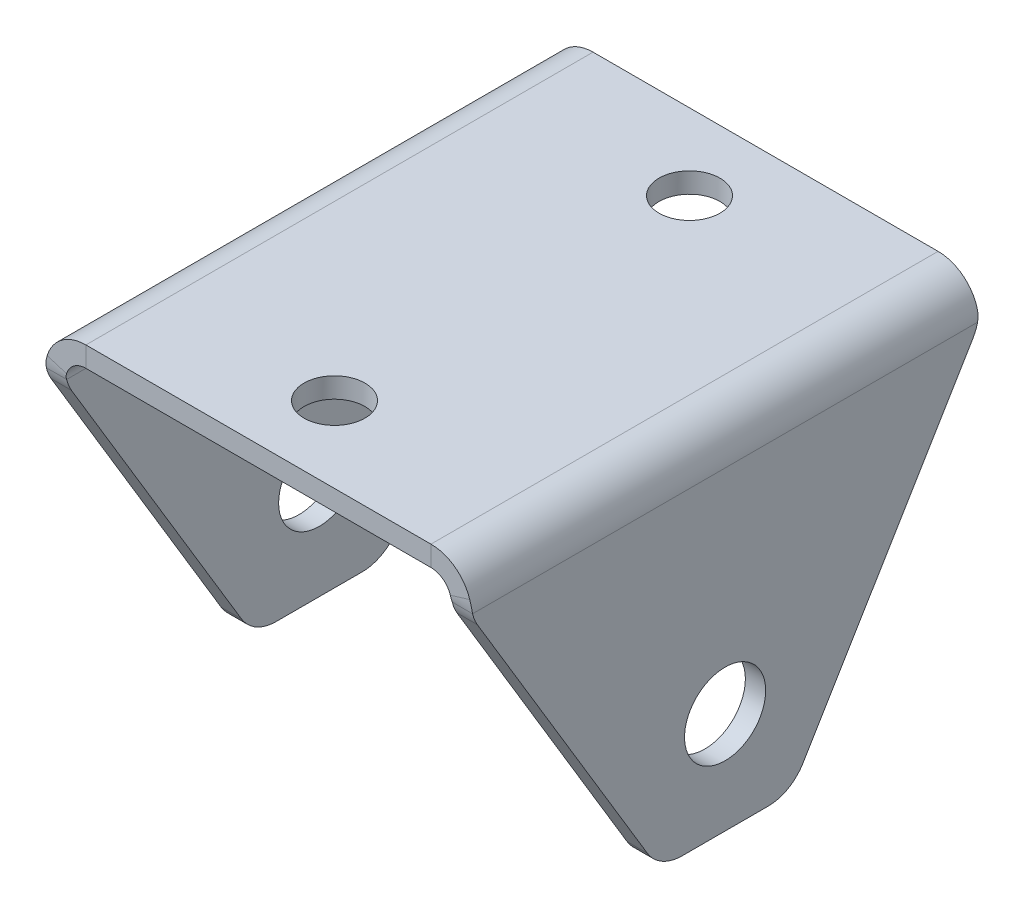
ISO-10303-21;
HEADER;
FILE_DESCRIPTION(('STEP AP214'),'2;1');
FILE_NAME('part.step','',(''),(''),'','','');
FILE_SCHEMA(('AUTOMOTIVE_DESIGN { 1 0 10303 214 1 1 1 1 }'));
ENDSEC;
DATA;
#1=APPLICATION_CONTEXT('core data for automotive mechanical design processes');
#2=APPLICATION_PROTOCOL_DEFINITION('international standard','automotive_design',2000,#1);
#3=PRODUCT_CONTEXT('',#1,'mechanical');
#4=PRODUCT('Part','Part','',(#3));
#5=PRODUCT_RELATED_PRODUCT_CATEGORY('part','',(#4));
#6=PRODUCT_DEFINITION_FORMATION('','',#4);
#7=PRODUCT_DEFINITION_CONTEXT('part definition',#1,'design');
#8=PRODUCT_DEFINITION('design','',#6,#7);
#9=PRODUCT_DEFINITION_SHAPE('','',#8);
#10=(LENGTH_UNIT() NAMED_UNIT(*) SI_UNIT(.MILLI.,.METRE.));
#11=(NAMED_UNIT(*) PLANE_ANGLE_UNIT() SI_UNIT($,.RADIAN.));
#12=(NAMED_UNIT(*) SI_UNIT($,.STERADIAN.) SOLID_ANGLE_UNIT());
#13=UNCERTAINTY_MEASURE_WITH_UNIT(LENGTH_MEASURE(1.E-05),#10,'distance_accuracy_value','');
#14=(GEOMETRIC_REPRESENTATION_CONTEXT(3) GLOBAL_UNCERTAINTY_ASSIGNED_CONTEXT((#13)) GLOBAL_UNIT_ASSIGNED_CONTEXT((#10,
#11,#12)) REPRESENTATION_CONTEXT('',''));
#15=CARTESIAN_POINT('',(0.,0.,0.));
#16=DIRECTION('',(0.,0.,1.));
#17=DIRECTION('',(1.,0.,0.));
#18=AXIS2_PLACEMENT_3D('',#15,#16,#17);
#19=CARTESIAN_POINT('',(-96.6513977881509,-6.00000000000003,-4.23690888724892));
#20=DIRECTION('',(-1.,0.,0.));
#21=DIRECTION('',(0.,-1.,0.));
#22=AXIS2_PLACEMENT_3D('',#19,#20,#21);
#23=CYLINDRICAL_SURFACE('',#22,4.);
#24=CARTESIAN_POINT('',(19.0091308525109,-5.99999999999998,-4.23690888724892));
#25=DIRECTION('',(1.,0.,0.));
#26=DIRECTION('',(0.,1.,0.));
#27=AXIS2_PLACEMENT_3D('',#24,#25,#26);
#28=CIRCLE('',#27,4.);
#29=CARTESIAN_POINT('',(19.0091308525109,-8.0601522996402,-7.66557809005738));
#30=VERTEX_POINT('',#29);
#31=CARTESIAN_POINT('',(19.0091308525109,-9.99999999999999,-4.23690888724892));
#32=VERTEX_POINT('',#31);
#33=EDGE_CURVE('E11',#30,#32,#28,.F.);
#34=ORIENTED_EDGE('',*,*,#33,.F.);
#35=DIRECTION('',(1.,0.,0.));
#36=VECTOR('',#35,1.);
#37=CARTESIAN_POINT('',(19.0091308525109,-8.0601522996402,-7.66557809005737));
#38=LINE('',#37,#36);
#39=CARTESIAN_POINT('',(21.0091308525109,-8.0601522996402,-7.66557809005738));
#40=VERTEX_POINT('',#39);
#41=EDGE_CURVE('E681',#40,#30,#38,.F.);
#42=ORIENTED_EDGE('',*,*,#41,.F.);
#43=CARTESIAN_POINT('',(21.0091308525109,-5.99999999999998,-4.23690888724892));
#44=DIRECTION('',(-1.,0.,0.));
#45=DIRECTION('',(0.,-1.,0.));
#46=AXIS2_PLACEMENT_3D('',#43,#44,#45);
#47=CIRCLE('',#46,4.);
#48=CARTESIAN_POINT('',(21.0091308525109,-9.99999999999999,-4.23690888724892));
#49=VERTEX_POINT('',#48);
#50=EDGE_CURVE('E92',#49,#40,#47,.F.);
#51=ORIENTED_EDGE('',*,*,#50,.F.);
#52=DIRECTION('',(1.,0.,0.));
#53=VECTOR('',#52,1.);
#54=CARTESIAN_POINT('',(21.0091308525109,-9.99999999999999,-4.23690888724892));
#55=LINE('',#54,#53);
#56=EDGE_CURVE('E697',#32,#49,#55,.T.);
#57=ORIENTED_EDGE('',*,*,#56,.F.);
#58=EDGE_LOOP('',(#34,#42,#51,#57));
#59=FACE_BOUND('',#58,.T.);
#60=ADVANCED_FACE('F35',(#59),#23,.T.);
#61=CARTESIAN_POINT('',(-96.6513977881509,-10.,25.));
#62=DIRECTION('',(0.,-1.,0.));
#63=DIRECTION('',(1.,0.,0.));
#64=AXIS2_PLACEMENT_3D('',#61,#62,#63);
#65=PLANE('',#64);
#66=DIRECTION('',(0.,0.,-1.));
#67=VECTOR('',#66,1.);
#68=CARTESIAN_POINT('',(21.0091308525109,-9.99999999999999,25.));
#69=LINE('',#68,#67);
#70=CARTESIAN_POINT('',(21.0091308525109,-9.99999999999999,4.23690888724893));
#71=VERTEX_POINT('',#70);
#72=EDGE_CURVE('E672',#71,#49,#69,.T.);
#73=ORIENTED_EDGE('',*,*,#72,.F.);
#74=DIRECTION('',(1.,0.,0.));
#75=VECTOR('',#74,1.);
#76=CARTESIAN_POINT('',(19.0091308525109,-9.99999999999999,4.23690888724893));
#77=LINE('',#76,#75);
#78=CARTESIAN_POINT('',(19.0091308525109,-9.99999999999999,4.23690888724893));
#79=VERTEX_POINT('',#78);
#80=EDGE_CURVE('E701',#71,#79,#77,.F.);
#81=ORIENTED_EDGE('',*,*,#80,.T.);
#82=DIRECTION('',(0.,0.,-1.));
#83=VECTOR('',#82,1.);
#84=CARTESIAN_POINT('',(19.0091308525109,-9.99999999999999,25.));
#85=LINE('',#84,#83);
#86=EDGE_CURVE('E699',#79,#32,#85,.T.);
#87=ORIENTED_EDGE('',*,*,#86,.T.);
#88=ORIENTED_EDGE('',*,*,#56,.T.);
#89=EDGE_LOOP('',(#73,#81,#87,#88));
#90=FACE_BOUND('',#89,.T.);
#91=ADVANCED_FACE('F749',(#90),#65,.T.);
#92=CARTESIAN_POINT('',(-96.6513977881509,-6.00000000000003,4.23690888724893));
#93=DIRECTION('',(-1.,0.,0.));
#94=DIRECTION('',(0.,-1.,0.));
#95=AXIS2_PLACEMENT_3D('',#92,#93,#94);
#96=CYLINDRICAL_SURFACE('',#95,4.);
#97=CARTESIAN_POINT('',(19.0091308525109,-5.99999999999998,4.23690888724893));
#98=DIRECTION('',(1.,0.,0.));
#99=DIRECTION('',(0.,1.,0.));
#100=AXIS2_PLACEMENT_3D('',#97,#98,#99);
#101=CIRCLE('',#100,4.);
#102=CARTESIAN_POINT('',(19.0091308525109,-8.0601522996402,7.66557809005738));
#103=VERTEX_POINT('',#102);
#104=EDGE_CURVE('E664',#79,#103,#101,.F.);
#105=ORIENTED_EDGE('',*,*,#104,.F.);
#106=ORIENTED_EDGE('',*,*,#80,.F.);
#107=CARTESIAN_POINT('',(21.0091308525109,-5.99999999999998,4.23690888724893));
#108=DIRECTION('',(-1.,0.,0.));
#109=DIRECTION('',(0.,-1.,0.));
#110=AXIS2_PLACEMENT_3D('',#107,#108,#109);
#111=CIRCLE('',#110,4.);
#112=CARTESIAN_POINT('',(21.0091308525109,-8.0601522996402,7.66557809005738));
#113=VERTEX_POINT('',#112);
#114=EDGE_CURVE('E675',#113,#71,#111,.F.);
#115=ORIENTED_EDGE('',*,*,#114,.F.);
#116=DIRECTION('',(1.,0.,0.));
#117=VECTOR('',#116,1.);
#118=CARTESIAN_POINT('',(21.0091308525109,-8.0601522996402,7.66557809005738));
#119=LINE('',#118,#117);
#120=EDGE_CURVE('E694',#103,#113,#119,.T.);
#121=ORIENTED_EDGE('',*,*,#120,.F.);
#122=EDGE_LOOP('',(#105,#106,#115,#121));
#123=FACE_BOUND('',#122,.T.);
#124=ADVANCED_FACE('F753',(#123),#96,.T.);
#125=CARTESIAN_POINT('',(-96.6513977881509,22.4135460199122,25.9760233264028));
#126=DIRECTION('',(0.,0.515038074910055,-0.857167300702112));
#127=DIRECTION('',(0.,0.857167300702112,0.515038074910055));
#128=AXIS2_PLACEMENT_3D('',#125,#126,#127);
#129=PLANE('',#128);
#130=DIRECTION('',(0.,0.857167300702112,0.515038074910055));
#131=VECTOR('',#130,1.);
#132=CARTESIAN_POINT('',(19.0091308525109,22.4135460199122,25.9760233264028));
#133=LINE('',#132,#131);
#134=CARTESIAN_POINT('',(19.0091308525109,19.8383163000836,24.4286692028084));
#135=VERTEX_POINT('',#134);
#136=EDGE_CURVE('E660',#103,#135,#133,.T.);
#137=ORIENTED_EDGE('',*,*,#136,.F.);
#138=ORIENTED_EDGE('',*,*,#120,.T.);
#139=DIRECTION('',(0.,0.857167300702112,0.515038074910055));
#140=VECTOR('',#139,1.);
#141=CARTESIAN_POINT('',(21.0091308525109,-10.,6.5));
#142=LINE('',#141,#140);
#143=CARTESIAN_POINT('',(21.0091308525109,19.8383163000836,24.4286692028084));
#144=VERTEX_POINT('',#143);
#145=EDGE_CURVE('E691',#113,#144,#142,.T.);
#146=ORIENTED_EDGE('',*,*,#145,.T.);
#147=DIRECTION('',(1.,0.,0.));
#148=VECTOR('',#147,1.);
#149=CARTESIAN_POINT('',(19.0091308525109,19.8383163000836,24.4286692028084));
#150=LINE('',#149,#148);
#151=EDGE_CURVE('E689',#144,#135,#150,.F.);
#152=ORIENTED_EDGE('',*,*,#151,.T.);
#153=EDGE_LOOP('',(#137,#138,#146,#152));
#154=FACE_BOUND('',#153,.T.);
#155=ADVANCED_FACE('F759',(#154),#129,.F.);
#156=CARTESIAN_POINT('',(21.0091308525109,0.,0.));
#157=DIRECTION('',(1.,0.,0.));
#158=DIRECTION('',(0.,0.,-1.));
#159=AXIS2_PLACEMENT_3D('',#156,#157,#158);
#160=CYLINDRICAL_SURFACE('',#159,3.99999999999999);
#161=CARTESIAN_POINT('',(21.0091308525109,0.,0.));
#162=DIRECTION('',(1.,0.,0.));
#163=DIRECTION('',(0.,0.,-1.));
#164=AXIS2_PLACEMENT_3D('',#161,#162,#163);
#165=CIRCLE('',#164,3.99999999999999);
#166=CARTESIAN_POINT('',(21.0091308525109,0.,-3.99999999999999));
#167=VERTEX_POINT('',#166);
#168=EDGE_CURVE('E686',#167,#167,#165,.T.);
#169=ORIENTED_EDGE('',*,*,#168,.T.);
#170=EDGE_LOOP('',(#169));
#171=FACE_BOUND('',#170,.T.);
#172=CARTESIAN_POINT('',(19.0091308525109,0.,0.));
#173=DIRECTION('',(1.,0.,0.));
#174=DIRECTION('',(0.,1.,0.));
#175=AXIS2_PLACEMENT_3D('',#172,#173,#174);
#176=CIRCLE('',#175,3.99999999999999);
#177=CARTESIAN_POINT('',(19.0091308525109,3.99999999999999,0.));
#178=VERTEX_POINT('',#177);
#179=EDGE_CURVE('E666',#178,#178,#176,.T.);
#180=ORIENTED_EDGE('',*,*,#179,.F.);
#181=EDGE_LOOP('',(#180));
#182=FACE_BOUND('',#181,.T.);
#183=ADVANCED_FACE('F762',(#171,#182),#160,.F.);
#184=CARTESIAN_POINT('',(-96.6513977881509,0.339856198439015,-12.7128123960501));
#185=DIRECTION('',(0.,0.515038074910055,0.857167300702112));
#186=DIRECTION('',(0.,-0.857167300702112,0.515038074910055));
#187=AXIS2_PLACEMENT_3D('',#184,#185,#186);
#188=PLANE('',#187);
#189=DIRECTION('',(0.,-0.857167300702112,0.515038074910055));
#190=VECTOR('',#189,1.);
#191=CARTESIAN_POINT('',(21.0091308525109,-10.,-6.5));
#192=LINE('',#191,#190);
#193=CARTESIAN_POINT('',(21.0091308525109,19.8383163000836,-24.4286692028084));
#194=VERTEX_POINT('',#193);
#195=EDGE_CURVE('E683',#194,#40,#192,.T.);
#196=ORIENTED_EDGE('',*,*,#195,.T.);
#197=ORIENTED_EDGE('',*,*,#41,.T.);
#198=DIRECTION('',(0.,-0.857167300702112,0.515038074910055));
#199=VECTOR('',#198,1.);
#200=CARTESIAN_POINT('',(19.0091308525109,0.339856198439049,-12.7128123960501));
#201=LINE('',#200,#199);
#202=CARTESIAN_POINT('',(19.0091308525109,19.8383163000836,-24.4286692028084));
#203=VERTEX_POINT('',#202);
#204=EDGE_CURVE('E46',#203,#30,#201,.T.);
#205=ORIENTED_EDGE('',*,*,#204,.F.);
#206=DIRECTION('',(1.,0.,0.));
#207=VECTOR('',#206,1.);
#208=CARTESIAN_POINT('',(21.0091308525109,19.8383163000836,-24.4286692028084));
#209=LINE('',#208,#207);
#210=EDGE_CURVE('E678',#203,#194,#209,.T.);
#211=ORIENTED_EDGE('',*,*,#210,.T.);
#212=EDGE_LOOP('',(#196,#197,#205,#211));
#213=FACE_BOUND('',#212,.T.);
#214=ADVANCED_FACE('F734',(#213),#188,.F.);
#215=CARTESIAN_POINT('',(-96.6513977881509,21.8984685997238,-21.));
#216=DIRECTION('',(-1.,0.,0.));
#217=DIRECTION('',(0.,-1.,0.));
#218=AXIS2_PLACEMENT_3D('',#215,#216,#217);
#219=CYLINDRICAL_SURFACE('',#218,4.);
#220=CARTESIAN_POINT('',(19.0091308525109,21.8984685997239,-21.));
#221=DIRECTION('',(1.,0.,0.));
#222=DIRECTION('',(0.,1.,0.));
#223=AXIS2_PLACEMENT_3D('',#220,#221,#222);
#224=CIRCLE('',#223,4.);
#225=CARTESIAN_POINT('',(19.0091308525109,21.,-24.8977883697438));
#226=VERTEX_POINT('',#225);
#227=EDGE_CURVE('E659',#226,#203,#224,.F.);
#228=ORIENTED_EDGE('',*,*,#227,.F.);
#229=CARTESIAN_POINT('',(21.0091308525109,21.,-24.8977883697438));
#230=CARTESIAN_POINT('',(19.0091308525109,21.,-24.8977883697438));
#231=B_SPLINE_CURVE_WITH_KNOTS('',1,(#229,#230),.UNSPECIFIED.,.F.,.F.,(2,2),(0.,1.),.UNSPECIFIED.);
#232=CARTESIAN_POINT('',(21.0091308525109,21.,-24.8977883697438));
#233=VERTEX_POINT('',#232);
#234=EDGE_CURVE('E677',#226,#233,#231,.F.);
#235=ORIENTED_EDGE('',*,*,#234,.T.);
#236=CARTESIAN_POINT('',(21.0091308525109,21.8984685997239,-21.));
#237=DIRECTION('',(-1.,0.,0.));
#238=DIRECTION('',(0.,-1.,0.));
#239=AXIS2_PLACEMENT_3D('',#236,#237,#238);
#240=CIRCLE('',#239,4.);
#241=EDGE_CURVE('E671',#194,#233,#240,.F.);
#242=ORIENTED_EDGE('',*,*,#241,.F.);
#243=ORIENTED_EDGE('',*,*,#210,.F.);
#244=EDGE_LOOP('',(#228,#235,#242,#243));
#245=FACE_BOUND('',#244,.T.);
#246=ADVANCED_FACE('F723',(#245),#219,.T.);
#247=CARTESIAN_POINT('',(21.0091308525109,-9.99999999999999,25.));
#248=DIRECTION('',(-1.,0.,0.));
#249=DIRECTION('',(0.,0.,1.));
#250=AXIS2_PLACEMENT_3D('',#247,#248,#249);
#251=PLANE('',#250);
#252=ORIENTED_EDGE('',*,*,#168,.F.);
#253=EDGE_LOOP('',(#252));
#254=FACE_BOUND('',#253,.T.);
#255=ORIENTED_EDGE('',*,*,#145,.F.);
#256=ORIENTED_EDGE('',*,*,#114,.T.);
#257=ORIENTED_EDGE('',*,*,#72,.T.);
#258=ORIENTED_EDGE('',*,*,#50,.T.);
#259=ORIENTED_EDGE('',*,*,#195,.F.);
#260=ORIENTED_EDGE('',*,*,#241,.T.);
#261=DIRECTION('',(0.,0.,1.));
#262=VECTOR('',#261,1.);
#263=CARTESIAN_POINT('',(21.0091308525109,21.,-25.));
#264=LINE('',#263,#262);
#265=CARTESIAN_POINT('',(21.0091308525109,21.,24.8977883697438));
#266=VERTEX_POINT('',#265);
#267=EDGE_CURVE('E256',#233,#266,#264,.T.);
#268=ORIENTED_EDGE('',*,*,#267,.T.);
#269=CARTESIAN_POINT('',(21.0091308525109,21.8984685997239,21.));
#270=DIRECTION('',(-1.,0.,0.));
#271=DIRECTION('',(0.,-1.,0.));
#272=AXIS2_PLACEMENT_3D('',#269,#270,#271);
#273=CIRCLE('',#272,4.);
#274=EDGE_CURVE('E704',#266,#144,#273,.F.);
#275=ORIENTED_EDGE('',*,*,#274,.T.);
#276=EDGE_LOOP('',(#255,#256,#257,#258,#259,#260,#268,#275));
#277=FACE_BOUND('',#276,.T.);
#278=ADVANCED_FACE('F733',(#254,#277),#251,.F.);
#279=CARTESIAN_POINT('',(19.0091308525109,21.8984685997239,21.));
#280=DIRECTION('',(-1.,0.,0.));
#281=DIRECTION('',(0.,-1.,0.));
#282=AXIS2_PLACEMENT_3D('',#279,#280,#281);
#283=CYLINDRICAL_SURFACE('',#282,4.);
#284=ORIENTED_EDGE('',*,*,#274,.F.);
#285=CARTESIAN_POINT('',(19.0091308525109,21.,24.8977883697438));
#286=CARTESIAN_POINT('',(21.0091308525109,21.,24.8977883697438));
#287=B_SPLINE_CURVE_WITH_KNOTS('',1,(#285,#286),.UNSPECIFIED.,.F.,.F.,(2,2),(0.,1.),.UNSPECIFIED.);
#288=CARTESIAN_POINT('',(19.0091308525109,21.,24.8977883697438));
#289=VERTEX_POINT('',#288);
#290=EDGE_CURVE('E669',#266,#289,#287,.F.);
#291=ORIENTED_EDGE('',*,*,#290,.T.);
#292=CARTESIAN_POINT('',(19.0091308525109,21.8984685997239,21.));
#293=DIRECTION('',(1.,0.,0.));
#294=DIRECTION('',(0.,1.,0.));
#295=AXIS2_PLACEMENT_3D('',#292,#293,#294);
#296=CIRCLE('',#295,4.);
#297=EDGE_CURVE('E663',#135,#289,#296,.F.);
#298=ORIENTED_EDGE('',*,*,#297,.F.);
#299=ORIENTED_EDGE('',*,*,#151,.F.);
#300=EDGE_LOOP('',(#284,#291,#298,#299));
#301=FACE_BOUND('',#300,.T.);
#302=ADVANCED_FACE('F737',(#301),#283,.T.);
#303=CARTESIAN_POINT('',(19.0091308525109,23.,25.));
#304=DIRECTION('',(1.,0.,0.));
#305=DIRECTION('',(0.,1.,0.));
#306=AXIS2_PLACEMENT_3D('',#303,#304,#305);
#307=PLANE('',#306);
#308=ORIENTED_EDGE('',*,*,#179,.T.);
#309=EDGE_LOOP('',(#308));
#310=FACE_BOUND('',#309,.T.);
#311=ORIENTED_EDGE('',*,*,#86,.F.);
#312=ORIENTED_EDGE('',*,*,#104,.T.);
#313=ORIENTED_EDGE('',*,*,#136,.T.);
#314=ORIENTED_EDGE('',*,*,#297,.T.);
#315=DIRECTION('',(0.,0.,-1.));
#316=VECTOR('',#315,1.);
#317=CARTESIAN_POINT('',(19.0091308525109,21.,-25.));
#318=LINE('',#317,#316);
#319=EDGE_CURVE('E721',#289,#226,#318,.T.);
#320=ORIENTED_EDGE('',*,*,#319,.T.);
#321=ORIENTED_EDGE('',*,*,#227,.T.);
#322=ORIENTED_EDGE('',*,*,#204,.T.);
#323=ORIENTED_EDGE('',*,*,#33,.T.);
#324=EDGE_LOOP('',(#311,#312,#313,#314,#320,#321,#322,#323));
#325=FACE_BOUND('',#324,.T.);
#326=ADVANCED_FACE('F37',(#310,#325),#307,.F.);
#327=CARTESIAN_POINT('',(96.6513977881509,-6.00000000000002,4.23690888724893));
#328=DIRECTION('',(-1.,0.,0.));
#329=DIRECTION('',(0.,-1.,0.));
#330=AXIS2_PLACEMENT_3D('',#327,#328,#329);
#331=CYLINDRICAL_SURFACE('',#330,4.);
#332=CARTESIAN_POINT('',(-19.0091308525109,-6.00000000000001,4.23690888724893));
#333=DIRECTION('',(-1.,0.,0.));
#334=DIRECTION('',(0.,-1.,0.));
#335=AXIS2_PLACEMENT_3D('',#332,#333,#334);
#336=CIRCLE('',#335,4.);
#337=CARTESIAN_POINT('',(-19.0091308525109,-8.06015229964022,7.66557809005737));
#338=VERTEX_POINT('',#337);
#339=CARTESIAN_POINT('',(-19.0091308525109,-10.,4.23690888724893));
#340=VERTEX_POINT('',#339);
#341=EDGE_CURVE('E560',#338,#340,#336,.F.);
#342=ORIENTED_EDGE('',*,*,#341,.F.);
#343=DIRECTION('',(-1.,0.,0.));
#344=VECTOR('',#343,1.);
#345=CARTESIAN_POINT('',(96.6513977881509,-8.06015229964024,7.66557809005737));
#346=LINE('',#345,#344);
#347=CARTESIAN_POINT('',(-21.0091308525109,-8.06015229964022,7.66557809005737));
#348=VERTEX_POINT('',#347);
#349=EDGE_CURVE('E583',#348,#338,#346,.F.);
#350=ORIENTED_EDGE('',*,*,#349,.F.);
#351=CARTESIAN_POINT('',(-21.0091308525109,-6.00000000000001,4.23690888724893));
#352=DIRECTION('',(1.,0.,0.));
#353=DIRECTION('',(0.,1.,0.));
#354=AXIS2_PLACEMENT_3D('',#351,#352,#353);
#355=CIRCLE('',#354,4.);
#356=CARTESIAN_POINT('',(-21.0091308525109,-10.,4.23690888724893));
#357=VERTEX_POINT('',#356);
#358=EDGE_CURVE('E149',#357,#348,#355,.F.);
#359=ORIENTED_EDGE('',*,*,#358,.F.);
#360=DIRECTION('',(-1.,0.,0.));
#361=VECTOR('',#360,1.);
#362=CARTESIAN_POINT('',(96.6513977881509,-10.,4.23690888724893));
#363=LINE('',#362,#361);
#364=EDGE_CURVE('E596',#340,#357,#363,.T.);
#365=ORIENTED_EDGE('',*,*,#364,.F.);
#366=EDGE_LOOP('',(#342,#350,#359,#365));
#367=FACE_BOUND('',#366,.T.);
#368=ADVANCED_FACE('F745',(#367),#331,.T.);
#369=CARTESIAN_POINT('',(96.6513977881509,-10.,25.));
#370=DIRECTION('',(0.,1.,0.));
#371=DIRECTION('',(-1.,0.,0.));
#372=AXIS2_PLACEMENT_3D('',#369,#370,#371);
#373=PLANE('',#372);
#374=DIRECTION('',(0.,0.,-1.));
#375=VECTOR('',#374,1.);
#376=CARTESIAN_POINT('',(-21.0091308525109,-10.,25.));
#377=LINE('',#376,#375);
#378=CARTESIAN_POINT('',(-21.0091308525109,-10.,-4.23690888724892));
#379=VERTEX_POINT('',#378);
#380=EDGE_CURVE('E553',#357,#379,#377,.T.);
#381=ORIENTED_EDGE('',*,*,#380,.T.);
#382=DIRECTION('',(-1.,0.,0.));
#383=VECTOR('',#382,1.);
#384=CARTESIAN_POINT('',(96.6513977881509,-10.,-4.23690888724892));
#385=LINE('',#384,#383);
#386=CARTESIAN_POINT('',(-19.0091308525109,-10.,-4.23690888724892));
#387=VERTEX_POINT('',#386);
#388=EDGE_CURVE('E598',#379,#387,#385,.F.);
#389=ORIENTED_EDGE('',*,*,#388,.T.);
#390=DIRECTION('',(0.,0.,-1.));
#391=VECTOR('',#390,1.);
#392=CARTESIAN_POINT('',(-19.0091308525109,-10.,25.));
#393=LINE('',#392,#391);
#394=EDGE_CURVE('E558',#340,#387,#393,.T.);
#395=ORIENTED_EDGE('',*,*,#394,.F.);
#396=ORIENTED_EDGE('',*,*,#364,.T.);
#397=EDGE_LOOP('',(#381,#389,#395,#396));
#398=FACE_BOUND('',#397,.T.);
#399=ADVANCED_FACE('F997',(#398),#373,.F.);
#400=CARTESIAN_POINT('',(96.6513977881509,-6.00000000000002,-4.23690888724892));
#401=DIRECTION('',(-1.,0.,0.));
#402=DIRECTION('',(0.,-1.,0.));
#403=AXIS2_PLACEMENT_3D('',#400,#401,#402);
#404=CYLINDRICAL_SURFACE('',#403,4.);
#405=CARTESIAN_POINT('',(-19.0091308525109,-6.00000000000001,-4.23690888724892));
#406=DIRECTION('',(-1.,0.,0.));
#407=DIRECTION('',(0.,-1.,0.));
#408=AXIS2_PLACEMENT_3D('',#405,#406,#407);
#409=CIRCLE('',#408,4.);
#410=CARTESIAN_POINT('',(-19.0091308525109,-8.06015229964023,-7.66557809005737));
#411=VERTEX_POINT('',#410);
#412=EDGE_CURVE('E110',#387,#411,#409,.F.);
#413=ORIENTED_EDGE('',*,*,#412,.F.);
#414=ORIENTED_EDGE('',*,*,#388,.F.);
#415=CARTESIAN_POINT('',(-21.0091308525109,-6.00000000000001,-4.23690888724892));
#416=DIRECTION('',(1.,0.,0.));
#417=DIRECTION('',(0.,1.,0.));
#418=AXIS2_PLACEMENT_3D('',#415,#416,#417);
#419=CIRCLE('',#418,4.);
#420=CARTESIAN_POINT('',(-21.0091308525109,-8.06015229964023,-7.66557809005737));
#421=VERTEX_POINT('',#420);
#422=EDGE_CURVE('E572',#421,#379,#419,.F.);
#423=ORIENTED_EDGE('',*,*,#422,.F.);
#424=DIRECTION('',(-1.,0.,0.));
#425=VECTOR('',#424,1.);
#426=CARTESIAN_POINT('',(96.6513977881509,-8.06015229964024,-7.66557809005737));
#427=LINE('',#426,#425);
#428=EDGE_CURVE('E593',#411,#421,#427,.T.);
#429=ORIENTED_EDGE('',*,*,#428,.F.);
#430=EDGE_LOOP('',(#413,#414,#423,#429));
#431=FACE_BOUND('',#430,.T.);
#432=ADVANCED_FACE('F987',(#431),#404,.T.);
#433=CARTESIAN_POINT('',(96.6513977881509,-23.9064245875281,1.85582288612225));
#434=DIRECTION('',(0.,0.515038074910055,0.857167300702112));
#435=DIRECTION('',(0.,0.857167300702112,-0.515038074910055));
#436=AXIS2_PLACEMENT_3D('',#433,#434,#435);
#437=PLANE('',#436);
#438=DIRECTION('',(0.,0.857167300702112,-0.515038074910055));
#439=VECTOR('',#438,1.);
#440=CARTESIAN_POINT('',(-19.0091308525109,-23.9064245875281,1.85582288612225));
#441=LINE('',#440,#439);
#442=CARTESIAN_POINT('',(-19.0091308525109,19.8383163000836,-24.4286692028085));
#443=VERTEX_POINT('',#442);
#444=EDGE_CURVE('E554',#411,#443,#441,.T.);
#445=ORIENTED_EDGE('',*,*,#444,.F.);
#446=ORIENTED_EDGE('',*,*,#428,.T.);
#447=DIRECTION('',(0.,-0.857167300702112,0.515038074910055));
#448=VECTOR('',#447,1.);
#449=CARTESIAN_POINT('',(-21.0091308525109,-10.,-6.5));
#450=LINE('',#449,#448);
#451=CARTESIAN_POINT('',(-21.0091308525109,19.8383163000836,-24.4286692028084));
#452=VERTEX_POINT('',#451);
#453=EDGE_CURVE('E574',#452,#421,#450,.T.);
#454=ORIENTED_EDGE('',*,*,#453,.F.);
#455=DIRECTION('',(-1.,0.,0.));
#456=VECTOR('',#455,1.);
#457=CARTESIAN_POINT('',(-19.0091308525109,19.8383163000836,-24.4286692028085));
#458=LINE('',#457,#456);
#459=EDGE_CURVE('E591',#452,#443,#458,.F.);
#460=ORIENTED_EDGE('',*,*,#459,.T.);
#461=EDGE_LOOP('',(#445,#446,#454,#460));
#462=FACE_BOUND('',#461,.T.);
#463=ADVANCED_FACE('F978',(#462),#437,.F.);
#464=CARTESIAN_POINT('',(21.0091308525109,0.,0.));
#465=DIRECTION('',(1.,0.,0.));
#466=DIRECTION('',(0.,0.,-1.));
#467=AXIS2_PLACEMENT_3D('',#464,#465,#466);
#468=CYLINDRICAL_SURFACE('',#467,3.99999999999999);
#469=CARTESIAN_POINT('',(-21.0091308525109,0.,0.));
#470=DIRECTION('',(1.,0.,0.));
#471=DIRECTION('',(0.,1.,0.));
#472=AXIS2_PLACEMENT_3D('',#469,#470,#471);
#473=CIRCLE('',#472,3.99999999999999);
#474=CARTESIAN_POINT('',(-21.0091308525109,3.99999999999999,0.));
#475=VERTEX_POINT('',#474);
#476=EDGE_CURVE('E588',#475,#475,#473,.F.);
#477=ORIENTED_EDGE('',*,*,#476,.T.);
#478=EDGE_LOOP('',(#477));
#479=FACE_BOUND('',#478,.T.);
#480=CARTESIAN_POINT('',(-19.0091308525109,0.,0.));
#481=DIRECTION('',(-1.,0.,0.));
#482=DIRECTION('',(0.,-1.,0.));
#483=AXIS2_PLACEMENT_3D('',#480,#481,#482);
#484=CIRCLE('',#483,3.99999999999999);
#485=CARTESIAN_POINT('',(-19.0091308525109,-3.99999999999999,0.));
#486=VERTEX_POINT('',#485);
#487=EDGE_CURVE('E566',#486,#486,#484,.T.);
#488=ORIENTED_EDGE('',*,*,#487,.F.);
#489=EDGE_LOOP('',(#488));
#490=FACE_BOUND('',#489,.T.);
#491=ADVANCED_FACE('F969',(#479,#490),#468,.F.);
#492=CARTESIAN_POINT('',(96.6513977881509,-1.83273476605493,11.4073880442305));
#493=DIRECTION('',(0.,0.515038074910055,-0.857167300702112));
#494=DIRECTION('',(0.,-0.857167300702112,-0.515038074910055));
#495=AXIS2_PLACEMENT_3D('',#492,#493,#494);
#496=PLANE('',#495);
#497=DIRECTION('',(0.,-0.857167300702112,-0.515038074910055));
#498=VECTOR('',#497,1.);
#499=CARTESIAN_POINT('',(-19.0091308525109,-1.83273476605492,11.4073880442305));
#500=LINE('',#499,#498);
#501=CARTESIAN_POINT('',(-19.0091308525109,19.8383163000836,24.4286692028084));
#502=VERTEX_POINT('',#501);
#503=EDGE_CURVE('E562',#502,#338,#500,.T.);
#504=ORIENTED_EDGE('',*,*,#503,.F.);
#505=DIRECTION('',(-1.,0.,0.));
#506=VECTOR('',#505,1.);
#507=CARTESIAN_POINT('',(-21.0091308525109,19.8383163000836,24.4286692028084));
#508=LINE('',#507,#506);
#509=CARTESIAN_POINT('',(-21.0091308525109,19.8383163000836,24.4286692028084));
#510=VERTEX_POINT('',#509);
#511=EDGE_CURVE('E585',#502,#510,#508,.T.);
#512=ORIENTED_EDGE('',*,*,#511,.T.);
#513=DIRECTION('',(0.,0.857167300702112,0.515038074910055));
#514=VECTOR('',#513,1.);
#515=CARTESIAN_POINT('',(-21.0091308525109,-10.,6.5));
#516=LINE('',#515,#514);
#517=EDGE_CURVE('E578',#348,#510,#516,.T.);
#518=ORIENTED_EDGE('',*,*,#517,.F.);
#519=ORIENTED_EDGE('',*,*,#349,.T.);
#520=EDGE_LOOP('',(#504,#512,#518,#519));
#521=FACE_BOUND('',#520,.T.);
#522=ADVANCED_FACE('F634',(#521),#496,.F.);
#523=CARTESIAN_POINT('',(96.6513977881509,21.8984685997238,21.));
#524=DIRECTION('',(1.,0.,0.));
#525=DIRECTION('',(0.,1.,0.));
#526=AXIS2_PLACEMENT_3D('',#523,#524,#525);
#527=CYLINDRICAL_SURFACE('',#526,4.);
#528=CARTESIAN_POINT('',(-19.0091308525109,21.8984685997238,21.));
#529=DIRECTION('',(-1.,0.,0.));
#530=DIRECTION('',(0.,-1.,0.));
#531=AXIS2_PLACEMENT_3D('',#528,#529,#530);
#532=CIRCLE('',#531,4.);
#533=CARTESIAN_POINT('',(-19.0091308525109,21.,24.8977883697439));
#534=VERTEX_POINT('',#533);
#535=EDGE_CURVE('E565',#534,#502,#532,.F.);
#536=ORIENTED_EDGE('',*,*,#535,.F.);
#537=CARTESIAN_POINT('',(-21.0091308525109,21.,24.8977883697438));
#538=CARTESIAN_POINT('',(-19.0091308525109,21.,24.8977883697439));
#539=B_SPLINE_CURVE_WITH_KNOTS('',1,(#537,#538),.UNSPECIFIED.,.F.,.F.,(2,2),(0.,1.),.UNSPECIFIED.);
#540=CARTESIAN_POINT('',(-21.0091308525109,21.,24.8977883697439));
#541=VERTEX_POINT('',#540);
#542=EDGE_CURVE('E582',#534,#541,#539,.F.);
#543=ORIENTED_EDGE('',*,*,#542,.T.);
#544=CARTESIAN_POINT('',(-21.0091308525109,21.8984685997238,21.));
#545=DIRECTION('',(1.,0.,0.));
#546=DIRECTION('',(0.,1.,0.));
#547=AXIS2_PLACEMENT_3D('',#544,#545,#546);
#548=CIRCLE('',#547,4.);
#549=EDGE_CURVE('E581',#510,#541,#548,.F.);
#550=ORIENTED_EDGE('',*,*,#549,.F.);
#551=ORIENTED_EDGE('',*,*,#511,.F.);
#552=EDGE_LOOP('',(#536,#543,#550,#551));
#553=FACE_BOUND('',#552,.T.);
#554=ADVANCED_FACE('F623',(#553),#527,.T.);
#555=CARTESIAN_POINT('',(-21.0091308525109,25.,25.));
#556=DIRECTION('',(1.,0.,0.));
#557=DIRECTION('',(0.,1.,0.));
#558=AXIS2_PLACEMENT_3D('',#555,#556,#557);
#559=PLANE('',#558);
#560=ORIENTED_EDGE('',*,*,#476,.F.);
#561=EDGE_LOOP('',(#560));
#562=FACE_BOUND('',#561,.T.);
#563=ORIENTED_EDGE('',*,*,#517,.T.);
#564=ORIENTED_EDGE('',*,*,#549,.T.);
#565=DIRECTION('',(0.,0.,-1.));
#566=VECTOR('',#565,1.);
#567=CARTESIAN_POINT('',(-21.0091308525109,21.,25.));
#568=LINE('',#567,#566);
#569=CARTESIAN_POINT('',(-21.0091308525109,21.,-24.8977883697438));
#570=VERTEX_POINT('',#569);
#571=EDGE_CURVE('E602',#541,#570,#568,.T.);
#572=ORIENTED_EDGE('',*,*,#571,.T.);
#573=CARTESIAN_POINT('',(-21.0091308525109,21.8984685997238,-21.));
#574=DIRECTION('',(1.,0.,0.));
#575=DIRECTION('',(0.,1.,0.));
#576=AXIS2_PLACEMENT_3D('',#573,#574,#575);
#577=CIRCLE('',#576,4.);
#578=EDGE_CURVE('E577',#570,#452,#577,.F.);
#579=ORIENTED_EDGE('',*,*,#578,.T.);
#580=ORIENTED_EDGE('',*,*,#453,.T.);
#581=ORIENTED_EDGE('',*,*,#422,.T.);
#582=ORIENTED_EDGE('',*,*,#380,.F.);
#583=ORIENTED_EDGE('',*,*,#358,.T.);
#584=EDGE_LOOP('',(#563,#564,#572,#579,#580,#581,#582,#583));
#585=FACE_BOUND('',#584,.T.);
#586=ADVANCED_FACE('F633',(#562,#585),#559,.F.);
#587=CARTESIAN_POINT('',(-19.0091308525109,21.8984685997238,-21.));
#588=DIRECTION('',(1.,0.,0.));
#589=DIRECTION('',(0.,1.,0.));
#590=AXIS2_PLACEMENT_3D('',#587,#588,#589);
#591=CYLINDRICAL_SURFACE('',#590,4.);
#592=ORIENTED_EDGE('',*,*,#578,.F.);
#593=CARTESIAN_POINT('',(-19.0091308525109,21.,-24.8977883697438));
#594=CARTESIAN_POINT('',(-21.0091308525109,21.,-24.8977883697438));
#595=B_SPLINE_CURVE_WITH_KNOTS('',1,(#593,#594),.UNSPECIFIED.,.F.,.F.,(2,2),(0.,1.),.UNSPECIFIED.);
#596=CARTESIAN_POINT('',(-19.0091308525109,21.,-24.8977883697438));
#597=VERTEX_POINT('',#596);
#598=EDGE_CURVE('E570',#570,#597,#595,.F.);
#599=ORIENTED_EDGE('',*,*,#598,.T.);
#600=CARTESIAN_POINT('',(-19.0091308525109,21.8984685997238,-21.));
#601=DIRECTION('',(-1.,0.,0.));
#602=DIRECTION('',(0.,-1.,0.));
#603=AXIS2_PLACEMENT_3D('',#600,#601,#602);
#604=CIRCLE('',#603,4.);
#605=EDGE_CURVE('E556',#443,#597,#604,.F.);
#606=ORIENTED_EDGE('',*,*,#605,.F.);
#607=ORIENTED_EDGE('',*,*,#459,.F.);
#608=EDGE_LOOP('',(#592,#599,#606,#607));
#609=FACE_BOUND('',#608,.T.);
#610=ADVANCED_FACE('F638',(#609),#591,.T.);
#611=CARTESIAN_POINT('',(-19.0091308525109,-10.,25.));
#612=DIRECTION('',(-1.,0.,0.));
#613=DIRECTION('',(0.,-1.,0.));
#614=AXIS2_PLACEMENT_3D('',#611,#612,#613);
#615=PLANE('',#614);
#616=ORIENTED_EDGE('',*,*,#487,.T.);
#617=EDGE_LOOP('',(#616));
#618=FACE_BOUND('',#617,.T.);
#619=DIRECTION('',(0.,0.,1.));
#620=VECTOR('',#619,1.);
#621=CARTESIAN_POINT('',(-19.0091308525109,21.,25.));
#622=LINE('',#621,#620);
#623=EDGE_CURVE('E569',#597,#534,#622,.T.);
#624=ORIENTED_EDGE('',*,*,#623,.T.);
#625=ORIENTED_EDGE('',*,*,#535,.T.);
#626=ORIENTED_EDGE('',*,*,#503,.T.);
#627=ORIENTED_EDGE('',*,*,#341,.T.);
#628=ORIENTED_EDGE('',*,*,#394,.T.);
#629=ORIENTED_EDGE('',*,*,#412,.T.);
#630=ORIENTED_EDGE('',*,*,#444,.T.);
#631=ORIENTED_EDGE('',*,*,#605,.T.);
#632=EDGE_LOOP('',(#624,#625,#626,#627,#628,#629,#630,#631));
#633=FACE_BOUND('',#632,.T.);
#634=ADVANCED_FACE('F643',(#618,#633),#615,.F.);
#635=CARTESIAN_POINT('',(21.0091308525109,25.,25.));
#636=DIRECTION('',(0.,-1.,0.));
#637=DIRECTION('',(1.,0.,0.));
#638=AXIS2_PLACEMENT_3D('',#635,#636,#637);
#639=PLANE('',#638);
#640=CARTESIAN_POINT('',(0.,25.,-17.5));
#641=DIRECTION('',(0.,1.,0.));
#642=DIRECTION('',(0.,0.,1.));
#643=AXIS2_PLACEMENT_3D('',#640,#641,#642);
#644=CIRCLE('',#643,2.99999999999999);
#645=CARTESIAN_POINT('',(0.,25.,-14.5));
#646=VERTEX_POINT('',#645);
#647=EDGE_CURVE('E527',#646,#646,#644,.T.);
#648=ORIENTED_EDGE('',*,*,#647,.F.);
#649=EDGE_LOOP('',(#648));
#650=FACE_BOUND('',#649,.T.);
#651=CARTESIAN_POINT('',(0.,25.,17.5));
#652=DIRECTION('',(0.,1.,0.));
#653=DIRECTION('',(0.,0.,1.));
#654=AXIS2_PLACEMENT_3D('',#651,#652,#653);
#655=CIRCLE('',#654,2.99999999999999);
#656=CARTESIAN_POINT('',(0.,25.,20.5));
#657=VERTEX_POINT('',#656);
#658=EDGE_CURVE('E534',#657,#657,#655,.T.);
#659=ORIENTED_EDGE('',*,*,#658,.F.);
#660=EDGE_LOOP('',(#659));
#661=FACE_BOUND('',#660,.T.);
#662=DIRECTION('',(0.,0.,1.));
#663=VECTOR('',#662,1.);
#664=CARTESIAN_POINT('',(17.0091308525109,25.,-25.));
#665=LINE('',#664,#663);
#666=CARTESIAN_POINT('',(17.0091308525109,25.,-25.));
#667=VERTEX_POINT('',#666);
#668=CARTESIAN_POINT('',(17.0091308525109,25.,25.));
#669=VERTEX_POINT('',#668);
#670=EDGE_CURVE('E170',#667,#669,#665,.T.);
#671=ORIENTED_EDGE('',*,*,#670,.F.);
#672=DIRECTION('',(-1.,0.,0.));
#673=VECTOR('',#672,1.);
#674=CARTESIAN_POINT('',(21.0091308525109,25.,-25.));
#675=LINE('',#674,#673);
#676=CARTESIAN_POINT('',(-17.0091308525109,25.,-24.9999999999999));
#677=VERTEX_POINT('',#676);
#678=EDGE_CURVE('E530',#667,#677,#675,.T.);
#679=ORIENTED_EDGE('',*,*,#678,.T.);
#680=DIRECTION('',(0.,0.,-1.));
#681=VECTOR('',#680,1.);
#682=CARTESIAN_POINT('',(-17.0091308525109,25.,25.));
#683=LINE('',#682,#681);
#684=CARTESIAN_POINT('',(-17.0091308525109,25.,25.));
#685=VERTEX_POINT('',#684);
#686=EDGE_CURVE('E165',#685,#677,#683,.T.);
#687=ORIENTED_EDGE('',*,*,#686,.F.);
#688=DIRECTION('',(-1.,0.,0.));
#689=VECTOR('',#688,1.);
#690=CARTESIAN_POINT('',(21.0091308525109,25.,25.));
#691=LINE('',#690,#689);
#692=EDGE_CURVE('E532',#669,#685,#691,.T.);
#693=ORIENTED_EDGE('',*,*,#692,.F.);
#694=EDGE_LOOP('',(#671,#679,#687,#693));
#695=FACE_BOUND('',#694,.T.);
#696=ADVANCED_FACE('F925',(#650,#661,#695),#639,.F.);
#697=CARTESIAN_POINT('',(-19.0091308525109,23.,25.));
#698=DIRECTION('',(0.,1.,0.));
#699=DIRECTION('',(-1.,0.,0.));
#700=AXIS2_PLACEMENT_3D('',#697,#698,#699);
#701=PLANE('',#700);
#702=CARTESIAN_POINT('',(0.,23.,-17.5));
#703=DIRECTION('',(0.,1.,0.));
#704=DIRECTION('',(-1.,0.,0.));
#705=AXIS2_PLACEMENT_3D('',#702,#703,#704);
#706=CIRCLE('',#705,2.99999999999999);
#707=CARTESIAN_POINT('',(-3.,23.,-17.5));
#708=VERTEX_POINT('',#707);
#709=EDGE_CURVE('E510',#708,#708,#706,.T.);
#710=ORIENTED_EDGE('',*,*,#709,.T.);
#711=EDGE_LOOP('',(#710));
#712=FACE_BOUND('',#711,.T.);
#713=CARTESIAN_POINT('',(0.,23.,17.5));
#714=DIRECTION('',(0.,1.,0.));
#715=DIRECTION('',(-1.,0.,0.));
#716=AXIS2_PLACEMENT_3D('',#713,#714,#715);
#717=CIRCLE('',#716,2.99999999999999);
#718=CARTESIAN_POINT('',(-2.99999999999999,23.,17.5));
#719=VERTEX_POINT('',#718);
#720=EDGE_CURVE('E518',#719,#719,#717,.T.);
#721=ORIENTED_EDGE('',*,*,#720,.T.);
#722=EDGE_LOOP('',(#721));
#723=FACE_BOUND('',#722,.T.);
#724=DIRECTION('',(0.,0.,-1.));
#725=VECTOR('',#724,1.);
#726=CARTESIAN_POINT('',(17.0091308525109,23.,-25.));
#727=LINE('',#726,#725);
#728=CARTESIAN_POINT('',(17.0091308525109,23.,25.));
#729=VERTEX_POINT('',#728);
#730=CARTESIAN_POINT('',(17.0091308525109,23.,-25.));
#731=VERTEX_POINT('',#730);
#732=EDGE_CURVE('E537',#729,#731,#727,.T.);
#733=ORIENTED_EDGE('',*,*,#732,.F.);
#734=DIRECTION('',(1.,0.,0.));
#735=VECTOR('',#734,1.);
#736=CARTESIAN_POINT('',(-19.0091308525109,23.,25.));
#737=LINE('',#736,#735);
#738=CARTESIAN_POINT('',(-17.0091308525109,23.,25.));
#739=VERTEX_POINT('',#738);
#740=EDGE_CURVE('E524',#739,#729,#737,.T.);
#741=ORIENTED_EDGE('',*,*,#740,.F.);
#742=DIRECTION('',(0.,0.,1.));
#743=VECTOR('',#742,1.);
#744=CARTESIAN_POINT('',(-17.0091308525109,23.,25.));
#745=LINE('',#744,#743);
#746=CARTESIAN_POINT('',(-17.0091308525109,23.,-25.));
#747=VERTEX_POINT('',#746);
#748=EDGE_CURVE('E549',#747,#739,#745,.T.);
#749=ORIENTED_EDGE('',*,*,#748,.F.);
#750=DIRECTION('',(1.,0.,0.));
#751=VECTOR('',#750,1.);
#752=CARTESIAN_POINT('',(-19.0091308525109,23.,-25.));
#753=LINE('',#752,#751);
#754=EDGE_CURVE('E521',#747,#731,#753,.T.);
#755=ORIENTED_EDGE('',*,*,#754,.T.);
#756=EDGE_LOOP('',(#733,#741,#749,#755));
#757=FACE_BOUND('',#756,.T.);
#758=ADVANCED_FACE('F798',(#712,#723,#757),#701,.F.);
#759=CARTESIAN_POINT('',(0.,25.,17.5));
#760=DIRECTION('',(0.,1.,0.));
#761=DIRECTION('',(0.,0.,1.));
#762=AXIS2_PLACEMENT_3D('',#759,#760,#761);
#763=CYLINDRICAL_SURFACE('',#762,2.99999999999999);
#764=ORIENTED_EDGE('',*,*,#720,.F.);
#765=EDGE_LOOP('',(#764));
#766=FACE_BOUND('',#765,.T.);
#767=ORIENTED_EDGE('',*,*,#658,.T.);
#768=EDGE_LOOP('',(#767));
#769=FACE_BOUND('',#768,.T.);
#770=ADVANCED_FACE('F899',(#766,#769),#763,.F.);
#771=CARTESIAN_POINT('',(0.,25.,-17.5));
#772=DIRECTION('',(0.,1.,0.));
#773=DIRECTION('',(0.,0.,1.));
#774=AXIS2_PLACEMENT_3D('',#771,#772,#773);
#775=CYLINDRICAL_SURFACE('',#774,2.99999999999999);
#776=ORIENTED_EDGE('',*,*,#709,.F.);
#777=EDGE_LOOP('',(#776));
#778=FACE_BOUND('',#777,.T.);
#779=ORIENTED_EDGE('',*,*,#647,.T.);
#780=EDGE_LOOP('',(#779));
#781=FACE_BOUND('',#780,.T.);
#782=ADVANCED_FACE('F896',(#778,#781),#775,.F.);
#783=CARTESIAN_POINT('',(-19.0091308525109,-95.9502729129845,-25.));
#784=DIRECTION('',(0.,0.,1.));
#785=DIRECTION('',(1.,0.,0.));
#786=AXIS2_PLACEMENT_3D('',#783,#784,#785);
#787=PLANE('',#786);
#788=DIRECTION('',(0.,1.,0.));
#789=VECTOR('',#788,1.);
#790=CARTESIAN_POINT('',(-17.0091308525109,-95.9502729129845,-25.));
#791=LINE('',#790,#789);
#792=EDGE_CURVE('E541',#747,#677,#791,.T.);
#793=ORIENTED_EDGE('',*,*,#792,.T.);
#794=ORIENTED_EDGE('',*,*,#678,.F.);
#795=DIRECTION('',(0.,1.,0.));
#796=VECTOR('',#795,1.);
#797=CARTESIAN_POINT('',(17.0091308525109,-95.9502729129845,-25.));
#798=LINE('',#797,#796);
#799=EDGE_CURVE('E262',#731,#667,#798,.T.);
#800=ORIENTED_EDGE('',*,*,#799,.F.);
#801=ORIENTED_EDGE('',*,*,#754,.F.);
#802=EDGE_LOOP('',(#793,#794,#800,#801));
#803=FACE_BOUND('',#802,.T.);
#804=ADVANCED_FACE('F887',(#803),#787,.F.);
#805=CARTESIAN_POINT('',(-19.0091308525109,-95.9502729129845,25.));
#806=DIRECTION('',(0.,0.,1.));
#807=DIRECTION('',(1.,0.,0.));
#808=AXIS2_PLACEMENT_3D('',#805,#806,#807);
#809=PLANE('',#808);
#810=ORIENTED_EDGE('',*,*,#692,.T.);
#811=DIRECTION('',(0.,1.,0.));
#812=VECTOR('',#811,1.);
#813=CARTESIAN_POINT('',(-17.0091308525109,-95.9502729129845,25.));
#814=LINE('',#813,#812);
#815=EDGE_CURVE('E543',#739,#685,#814,.T.);
#816=ORIENTED_EDGE('',*,*,#815,.F.);
#817=ORIENTED_EDGE('',*,*,#740,.T.);
#818=DIRECTION('',(0.,1.,0.));
#819=VECTOR('',#818,1.);
#820=CARTESIAN_POINT('',(17.0091308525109,-95.9502729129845,25.));
#821=LINE('',#820,#819);
#822=EDGE_CURVE('E546',#729,#669,#821,.T.);
#823=ORIENTED_EDGE('',*,*,#822,.T.);
#824=EDGE_LOOP('',(#810,#816,#817,#823));
#825=FACE_BOUND('',#824,.T.);
#826=ADVANCED_FACE('F466',(#825),#809,.T.);
#827=CARTESIAN_POINT('',(-20.8310797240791,22.1801300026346,-25.));
#828=CARTESIAN_POINT('',(-20.8610956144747,22.0829210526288,-24.999926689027));
#829=CARTESIAN_POINT('',(-20.8872136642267,21.9851741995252,-24.9977518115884));
#830=CARTESIAN_POINT('',(-20.9206406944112,21.8382209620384,-24.9913371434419));
#831=CARTESIAN_POINT('',(-20.9308250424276,21.7891809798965,-24.9886735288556));
#832=CARTESIAN_POINT('',(-20.944679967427,21.7155949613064,-24.9838900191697));
#833=CARTESIAN_POINT('',(-20.9490613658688,21.6910619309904,-24.9821641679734));
#834=CARTESIAN_POINT('',(-20.9573531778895,21.6419965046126,-24.9784497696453));
#835=CARTESIAN_POINT('',(-20.9610955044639,21.6185855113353,-24.9765581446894));
#836=CARTESIAN_POINT('',(-20.9726290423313,21.5416388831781,-24.9699076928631));
#837=CARTESIAN_POINT('',(-20.979170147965,21.4911948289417,-24.9650368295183));
#838=CARTESIAN_POINT('',(-20.9874252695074,21.4168868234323,-24.9570746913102));
#839=CARTESIAN_POINT('',(-20.9899175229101,21.3923436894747,-24.9543113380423));
#840=CARTESIAN_POINT('',(-20.9932870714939,21.355876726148,-24.9500023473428));
#841=CARTESIAN_POINT('',(-20.9943487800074,21.3437790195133,-24.94853869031));
#842=CARTESIAN_POINT('',(-20.9958516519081,21.3257203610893,-24.9463022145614));
#843=CARTESIAN_POINT('',(-20.9963376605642,21.3197154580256,-24.9455498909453));
#844=CARTESIAN_POINT('',(-20.9972801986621,21.3077351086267,-24.9440315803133));
#845=CARTESIAN_POINT('',(-20.9978587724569,21.3001138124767,-24.9430522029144));
#846=CARTESIAN_POINT('',(-21.0032979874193,21.2267623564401,-24.9335419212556));
#847=CARTESIAN_POINT('',(-21.0091308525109,21.1281787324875,-24.9186445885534));
#848=CARTESIAN_POINT('',(-21.0091308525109,21.,-24.8977883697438));
#849=CARTESIAN_POINT('',(-18.920105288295,21.5900650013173,-24.9999999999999));
#850=CARTESIAN_POINT('',(-18.9351132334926,21.5414605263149,-24.999926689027));
#851=CARTESIAN_POINT('',(-18.9481722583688,21.4925870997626,-24.9977518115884));
#852=CARTESIAN_POINT('',(-18.9648857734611,21.4191104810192,-24.9913371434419));
#853=CARTESIAN_POINT('',(-18.9699779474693,21.3945904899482,-24.9886735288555));
#854=CARTESIAN_POINT('',(-18.976905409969,21.3577974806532,-24.9838900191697));
#855=CARTESIAN_POINT('',(-18.9790961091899,21.3455309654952,-24.9821641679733));
#856=CARTESIAN_POINT('',(-18.9832420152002,21.3209982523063,-24.9784497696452));
#857=CARTESIAN_POINT('',(-18.9851131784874,21.3092927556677,-24.9765581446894));
#858=CARTESIAN_POINT('',(-18.9908799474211,21.2708194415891,-24.969907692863));
#859=CARTESIAN_POINT('',(-18.994150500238,21.2455974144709,-24.9650368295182));
#860=CARTESIAN_POINT('',(-18.9982780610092,21.2084434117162,-24.9570746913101));
#861=CARTESIAN_POINT('',(-18.9995241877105,21.1961718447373,-24.9543113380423));
#862=CARTESIAN_POINT('',(-19.0012089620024,21.177938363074,-24.9500023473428));
#863=CARTESIAN_POINT('',(-19.0017398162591,21.1718895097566,-24.94853869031));
#864=CARTESIAN_POINT('',(-19.0024912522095,21.1628601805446,-24.9463022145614));
#865=CARTESIAN_POINT('',(-19.0027342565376,21.1598577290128,-24.9455498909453));
#866=CARTESIAN_POINT('',(-19.0032055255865,21.1538675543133,-24.9440315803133));
#867=CARTESIAN_POINT('',(-19.0034948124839,21.1500569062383,-24.9430522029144));
#868=CARTESIAN_POINT('',(-19.0062144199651,21.11338117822,-24.9335419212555));
#869=CARTESIAN_POINT('',(-19.0091308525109,21.0640884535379,-24.918644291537));
#870=CARTESIAN_POINT('',(-19.0091308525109,21.,-24.8977883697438));
#871=B_SPLINE_SURFACE_WITH_KNOTS('',1,3,((#827,#828,#829,#830,#831,#832,#833,#834,#835,#836,
#837,#838,#839,#840,#841,#842,#843,#844,#845,#846,#847,#848),(#849,#850,#851,#852,#853,#854,
#855,#856,#857,#858,#859,#860,#861,#862,#863,#864,#865,#866,#867,#868,#869,#870)),.UNSPECIFIED.,
.F.,.F.,.F.,(2,2),(4,2,2,2,2,2,2,2,2,2,4),(0.,1.),(0.,0.25,0.375,0.4375,0.5,0.625,0.6875,
0.71875,0.734375,0.75,1.),.UNSPECIFIED.);
#872=CARTESIAN_POINT('',(-20.8310797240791,22.1801300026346,-25.));
#873=CARTESIAN_POINT('',(-18.920105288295,21.5900650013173,-24.9999999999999));
#874=B_SPLINE_CURVE_WITH_KNOTS('',1,(#872,#873),.UNSPECIFIED.,.F.,.F.,(2,2),(0.,1.),.UNSPECIFIED.);
#875=CARTESIAN_POINT('',(-18.920105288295,21.5900650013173,-24.9999999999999));
#876=VERTEX_POINT('',#875);
#877=CARTESIAN_POINT('',(-20.8310797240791,22.1801300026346,-24.9999999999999));
#878=VERTEX_POINT('',#877);
#879=EDGE_CURVE('E498',#876,#878,#874,.F.);
#880=CARTESIAN_POINT('',(-18.920105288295,21.5900650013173,-24.9999999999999));
#881=CARTESIAN_POINT('',(-18.9351132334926,21.5414605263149,-24.999926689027));
#882=CARTESIAN_POINT('',(-18.9481722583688,21.4925870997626,-24.9977518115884));
#883=CARTESIAN_POINT('',(-18.9648857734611,21.4191104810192,-24.9913371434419));
#884=CARTESIAN_POINT('',(-18.9699779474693,21.3945904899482,-24.9886735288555));
#885=CARTESIAN_POINT('',(-18.976905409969,21.3577974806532,-24.9838900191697));
#886=CARTESIAN_POINT('',(-18.9790961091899,21.3455309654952,-24.9821641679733));
#887=CARTESIAN_POINT('',(-18.9832420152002,21.3209982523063,-24.9784497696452));
#888=CARTESIAN_POINT('',(-18.9851131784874,21.3092927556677,-24.9765581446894));
#889=CARTESIAN_POINT('',(-18.9908799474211,21.2708194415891,-24.969907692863));
#890=CARTESIAN_POINT('',(-18.994150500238,21.2455974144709,-24.9650368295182));
#891=CARTESIAN_POINT('',(-18.9982780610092,21.2084434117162,-24.9570746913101));
#892=CARTESIAN_POINT('',(-18.9995241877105,21.1961718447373,-24.9543113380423));
#893=CARTESIAN_POINT('',(-19.0012089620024,21.177938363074,-24.9500023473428));
#894=CARTESIAN_POINT('',(-19.0017398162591,21.1718895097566,-24.94853869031));
#895=CARTESIAN_POINT('',(-19.0024912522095,21.1628601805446,-24.9463022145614));
#896=CARTESIAN_POINT('',(-19.0027342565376,21.1598577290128,-24.9455498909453));
#897=CARTESIAN_POINT('',(-19.0032055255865,21.1538675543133,-24.9440315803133));
#898=CARTESIAN_POINT('',(-19.0034948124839,21.1500569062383,-24.9430522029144));
#899=CARTESIAN_POINT('',(-19.0062144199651,21.11338117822,-24.9335419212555));
#900=CARTESIAN_POINT('',(-19.0091308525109,21.0640884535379,-24.918644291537));
#901=CARTESIAN_POINT('',(-19.0091308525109,21.,-24.8977883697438));
#902=B_SPLINE_CURVE_WITH_KNOTS('',3,(#880,#881,#882,#883,#884,#885,#886,#887,#888,#889,#890,
#891,#892,#893,#894,#895,#896,#897,#898,#899,#900,#901),.UNSPECIFIED.,.F.,.F.,(4,2,2,2,2,2,2,2,
2,2,4),(0.,0.25,0.375,0.4375,0.5,0.625,0.6875,0.71875,0.734375,0.75,1.),.UNSPECIFIED.);
#903=EDGE_CURVE('E433',#876,#597,#902,.T.);
#904=CARTESIAN_POINT('',(-21.0091308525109,21.,-24.8977883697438));
#905=CARTESIAN_POINT('',(-21.0091308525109,21.1281787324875,-24.9186445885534));
#906=CARTESIAN_POINT('',(-21.0032979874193,21.2267623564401,-24.9335419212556));
#907=CARTESIAN_POINT('',(-20.9978587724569,21.3001138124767,-24.9430522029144));
#908=CARTESIAN_POINT('',(-20.9972801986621,21.3077351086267,-24.9440315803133));
#909=CARTESIAN_POINT('',(-20.9963376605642,21.3197154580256,-24.9455498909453));
#910=CARTESIAN_POINT('',(-20.9958516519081,21.3257203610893,-24.9463022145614));
#911=CARTESIAN_POINT('',(-20.9943487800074,21.3437790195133,-24.94853869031));
#912=CARTESIAN_POINT('',(-20.9932870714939,21.355876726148,-24.9500023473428));
#913=CARTESIAN_POINT('',(-20.9899175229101,21.3923436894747,-24.9543113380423));
#914=CARTESIAN_POINT('',(-20.9874252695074,21.4168868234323,-24.9570746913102));
#915=CARTESIAN_POINT('',(-20.979170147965,21.4911948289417,-24.9650368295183));
#916=CARTESIAN_POINT('',(-20.9726290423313,21.5416388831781,-24.9699076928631));
#917=CARTESIAN_POINT('',(-20.9610955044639,21.6185855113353,-24.9765581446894));
#918=CARTESIAN_POINT('',(-20.9573531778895,21.6419965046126,-24.9784497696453));
#919=CARTESIAN_POINT('',(-20.9490613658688,21.6910619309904,-24.9821641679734));
#920=CARTESIAN_POINT('',(-20.944679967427,21.7155949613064,-24.9838900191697));
#921=CARTESIAN_POINT('',(-20.9308250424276,21.7891809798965,-24.9886735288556));
#922=CARTESIAN_POINT('',(-20.9206406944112,21.8382209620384,-24.9913371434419));
#923=CARTESIAN_POINT('',(-20.8872136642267,21.9851741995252,-24.9977518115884));
#924=CARTESIAN_POINT('',(-20.8610956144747,22.0829210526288,-24.999926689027));
#925=CARTESIAN_POINT('',(-20.8310797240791,22.1801300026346,-25.));
#926=B_SPLINE_CURVE_WITH_KNOTS('',3,(#904,#905,#906,#907,#908,#909,#910,#911,#912,#913,#914,
#915,#916,#917,#918,#919,#920,#921,#922,#923,#924,#925),.UNSPECIFIED.,.F.,.F.,(4,2,2,2,2,2,2,2,
2,2,4),(0.,0.25,0.265625,0.28125,0.3125,0.375,0.5,0.5625,0.625,0.75,1.),.UNSPECIFIED.);
#927=EDGE_CURVE('E156',#878,#570,#926,.F.);
#928=ORIENTED_EDGE('',*,*,#879,.F.);
#929=ORIENTED_EDGE('',*,*,#903,.T.);
#930=ORIENTED_EDGE('',*,*,#598,.F.);
#931=ORIENTED_EDGE('',*,*,#927,.F.);
#932=EDGE_LOOP('',(#928,#929,#930,#931));
#933=FACE_BOUND('',#932,.T.);
#934=ADVANCED_FACE('F454',(#933),#871,.T.);
#935=CARTESIAN_POINT('',(-21.0091308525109,21.,24.8977883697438));
#936=CARTESIAN_POINT('',(-21.0091308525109,21.0991573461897,24.9148555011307));
#937=CARTESIAN_POINT('',(-21.0054420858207,21.198327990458,24.9297683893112));
#938=CARTESIAN_POINT('',(-20.9943866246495,21.3466926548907,24.9489063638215));
#939=CARTESIAN_POINT('',(-20.9897814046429,21.3960823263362,24.95474712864));
#940=CARTESIAN_POINT('',(-20.9787364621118,21.4946628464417,24.9653515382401));
#941=CARTESIAN_POINT('',(-20.9726250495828,21.5416632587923,24.969926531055));
#942=CARTESIAN_POINT('',(-20.9572626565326,21.6441588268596,24.9787540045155));
#943=CARTESIAN_POINT('',(-20.9487088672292,21.69443580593,24.9825727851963));
#944=CARTESIAN_POINT('',(-20.9347194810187,21.7683637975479,24.9874085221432));
#945=CARTESIAN_POINT('',(-20.9298631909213,21.7927586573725,24.9888716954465));
#946=CARTESIAN_POINT('',(-20.9223073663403,21.8289762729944,24.9908433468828));
#947=CARTESIAN_POINT('',(-20.919743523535,21.8409863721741,24.9914633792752));
#948=CARTESIAN_POINT('',(-20.9158321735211,21.8589075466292,24.9923376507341));
#949=CARTESIAN_POINT('',(-20.914517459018,21.8648656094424,24.9926197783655));
#950=CARTESIAN_POINT('',(-20.911866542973,21.8767503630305,24.9931654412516));
#951=CARTESIAN_POINT('',(-20.9101574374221,21.8843137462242,24.9934993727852));
#952=CARTESIAN_POINT('',(-20.8936019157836,21.9569766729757,24.9966247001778));
#953=CARTESIAN_POINT('',(-20.8697731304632,22.0548181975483,24.9987300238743));
#954=CARTESIAN_POINT('',(-20.8310797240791,22.1801300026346,25.));
#955=CARTESIAN_POINT('',(-19.0091308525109,21.,24.8977883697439));
#956=CARTESIAN_POINT('',(-19.0091308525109,21.0495786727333,24.9148555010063));
#957=CARTESIAN_POINT('',(-19.0072864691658,21.099163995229,24.9297683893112));
#958=CARTESIAN_POINT('',(-19.0017587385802,21.1733463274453,24.9489063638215));
#959=CARTESIAN_POINT('',(-18.9994561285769,21.1980411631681,24.95474712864));
#960=CARTESIAN_POINT('',(-18.9939336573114,21.2473314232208,24.9653515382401));
#961=CARTESIAN_POINT('',(-18.9908779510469,21.2708316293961,24.969926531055));
#962=CARTESIAN_POINT('',(-18.9831967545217,21.3220794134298,24.9787540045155));
#963=CARTESIAN_POINT('',(-18.9789198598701,21.347217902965,24.9825727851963));
#964=CARTESIAN_POINT('',(-18.9719251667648,21.384181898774,24.9874085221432));
#965=CARTESIAN_POINT('',(-18.9694970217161,21.3963793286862,24.9888716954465));
#966=CARTESIAN_POINT('',(-18.9657191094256,21.4144881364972,24.9908433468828));
#967=CARTESIAN_POINT('',(-18.9644371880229,21.4204931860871,24.9914633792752));
#968=CARTESIAN_POINT('',(-18.962481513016,21.4294537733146,24.9923376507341));
#969=CARTESIAN_POINT('',(-18.9618241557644,21.4324328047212,24.9926197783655));
#970=CARTESIAN_POINT('',(-18.960498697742,21.4383751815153,24.9931654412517));
#971=CARTESIAN_POINT('',(-18.9596441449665,21.4421568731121,24.9934993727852));
#972=CARTESIAN_POINT('',(-18.9513663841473,21.4784883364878,24.9966247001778));
#973=CARTESIAN_POINT('',(-18.9394519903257,21.5274091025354,24.9987300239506));
#974=CARTESIAN_POINT('',(-18.920105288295,21.5900650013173,25.));
#975=B_SPLINE_SURFACE_WITH_KNOTS('',1,3,((#935,#936,#937,#938,#939,#940,#941,#942,#943,#944,
#945,#946,#947,#948,#949,#950,#951,#952,#953,#954),(#955,#956,#957,#958,#959,#960,#961,#962,
#963,#964,#965,#966,#967,#968,#969,#970,#971,#972,#973,#974)),.UNSPECIFIED.,.F.,.F.,.F.,(2,2),
(4,2,2,2,2,2,2,2,2,4),(0.,1.),(0.,0.25,0.375,0.5,0.625,0.6875,0.71875,0.734375,0.75,1.),.UNSPECIFIED.);
#976=CARTESIAN_POINT('',(-19.0091308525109,21.,24.8977883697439));
#977=CARTESIAN_POINT('',(-19.0091308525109,21.0495786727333,24.9148555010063));
#978=CARTESIAN_POINT('',(-19.0072864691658,21.099163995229,24.9297683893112));
#979=CARTESIAN_POINT('',(-19.0017587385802,21.1733463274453,24.9489063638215));
#980=CARTESIAN_POINT('',(-18.9994561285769,21.1980411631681,24.95474712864));
#981=CARTESIAN_POINT('',(-18.9939336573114,21.2473314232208,24.9653515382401));
#982=CARTESIAN_POINT('',(-18.9908779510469,21.2708316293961,24.969926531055));
#983=CARTESIAN_POINT('',(-18.9831967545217,21.3220794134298,24.9787540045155));
#984=CARTESIAN_POINT('',(-18.9789198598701,21.347217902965,24.9825727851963));
#985=CARTESIAN_POINT('',(-18.9719251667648,21.384181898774,24.9874085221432));
#986=CARTESIAN_POINT('',(-18.9694970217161,21.3963793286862,24.9888716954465));
#987=CARTESIAN_POINT('',(-18.9657191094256,21.4144881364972,24.9908433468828));
#988=CARTESIAN_POINT('',(-18.9644371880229,21.4204931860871,24.9914633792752));
#989=CARTESIAN_POINT('',(-18.962481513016,21.4294537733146,24.9923376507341));
#990=CARTESIAN_POINT('',(-18.9618241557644,21.4324328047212,24.9926197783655));
#991=CARTESIAN_POINT('',(-18.960498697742,21.4383751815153,24.9931654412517));
#992=CARTESIAN_POINT('',(-18.9596441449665,21.4421568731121,24.9934993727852));
#993=CARTESIAN_POINT('',(-18.9513663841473,21.4784883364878,24.9966247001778));
#994=CARTESIAN_POINT('',(-18.9394519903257,21.5274091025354,24.9987300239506));
#995=CARTESIAN_POINT('',(-18.920105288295,21.5900650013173,25.));
#996=B_SPLINE_CURVE_WITH_KNOTS('',3,(#976,#977,#978,#979,#980,#981,#982,#983,#984,#985,#986,
#987,#988,#989,#990,#991,#992,#993,#994,#995),.UNSPECIFIED.,.F.,.F.,(4,2,2,2,2,2,2,2,2,4),(0.,
0.25,0.375,0.5,0.625,0.6875,0.71875,0.734375,0.75,1.),.UNSPECIFIED.);
#997=CARTESIAN_POINT('',(-18.920105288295,21.5900650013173,25.));
#998=VERTEX_POINT('',#997);
#999=EDGE_CURVE('E386',#534,#998,#996,.T.);
#1000=CARTESIAN_POINT('',(-18.920105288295,21.5900650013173,25.));
#1001=CARTESIAN_POINT('',(-20.8310797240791,22.1801300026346,25.));
#1002=B_SPLINE_CURVE_WITH_KNOTS('',1,(#1000,#1001),.UNSPECIFIED.,.F.,.F.,(2,2),(0.,1.),.UNSPECIFIED.);
#1003=CARTESIAN_POINT('',(-20.8310797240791,22.1801300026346,25.));
#1004=VERTEX_POINT('',#1003);
#1005=EDGE_CURVE('E425',#998,#1004,#1002,.T.);
#1006=CARTESIAN_POINT('',(-20.8310797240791,22.1801300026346,25.));
#1007=CARTESIAN_POINT('',(-20.8697731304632,22.0548181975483,24.9987300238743));
#1008=CARTESIAN_POINT('',(-20.8936019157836,21.9569766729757,24.9966247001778));
#1009=CARTESIAN_POINT('',(-20.9101574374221,21.8843137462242,24.9934993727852));
#1010=CARTESIAN_POINT('',(-20.911866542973,21.8767503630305,24.9931654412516));
#1011=CARTESIAN_POINT('',(-20.914517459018,21.8648656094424,24.9926197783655));
#1012=CARTESIAN_POINT('',(-20.9158321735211,21.8589075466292,24.9923376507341));
#1013=CARTESIAN_POINT('',(-20.919743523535,21.8409863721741,24.9914633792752));
#1014=CARTESIAN_POINT('',(-20.9223073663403,21.8289762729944,24.9908433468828));
#1015=CARTESIAN_POINT('',(-20.9298631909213,21.7927586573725,24.9888716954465));
#1016=CARTESIAN_POINT('',(-20.9347194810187,21.7683637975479,24.9874085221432));
#1017=CARTESIAN_POINT('',(-20.9487088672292,21.69443580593,24.9825727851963));
#1018=CARTESIAN_POINT('',(-20.9572626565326,21.6441588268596,24.9787540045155));
#1019=CARTESIAN_POINT('',(-20.9726250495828,21.5416632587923,24.969926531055));
#1020=CARTESIAN_POINT('',(-20.9787364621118,21.4946628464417,24.9653515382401));
#1021=CARTESIAN_POINT('',(-20.9897814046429,21.3960823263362,24.95474712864));
#1022=CARTESIAN_POINT('',(-20.9943866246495,21.3466926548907,24.9489063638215));
#1023=CARTESIAN_POINT('',(-21.0054420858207,21.198327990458,24.9297683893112));
#1024=CARTESIAN_POINT('',(-21.0091308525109,21.0991573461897,24.9148555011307));
#1025=CARTESIAN_POINT('',(-21.0091308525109,21.,24.8977883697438));
#1026=B_SPLINE_CURVE_WITH_KNOTS('',3,(#1006,#1007,#1008,#1009,#1010,#1011,#1012,#1013,#1014,
#1015,#1016,#1017,#1018,#1019,#1020,#1021,#1022,#1023,#1024,#1025),.UNSPECIFIED.,.F.,.F.,(4,2,2,
2,2,2,2,2,2,4),(0.,0.25,0.265625,0.28125,0.3125,0.375,0.5,0.625,0.75,1.),.UNSPECIFIED.);
#1027=EDGE_CURVE('E1111',#541,#1004,#1026,.F.);
#1028=ORIENTED_EDGE('',*,*,#542,.F.);
#1029=ORIENTED_EDGE('',*,*,#999,.T.);
#1030=ORIENTED_EDGE('',*,*,#1005,.T.);
#1031=ORIENTED_EDGE('',*,*,#1027,.F.);
#1032=EDGE_LOOP('',(#1028,#1029,#1030,#1031));
#1033=FACE_BOUND('',#1032,.T.);
#1034=ADVANCED_FACE('F465',(#1033),#975,.T.);
#1035=CARTESIAN_POINT('',(-17.0091308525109,21.,25.));
#1036=DIRECTION('',(0.,0.,1.));
#1037=DIRECTION('',(1.,0.,0.));
#1038=AXIS2_PLACEMENT_3D('',#1035,#1036,#1037);
#1039=PLANE('',#1038);
#1040=ORIENTED_EDGE('',*,*,#1005,.F.);
#1041=CARTESIAN_POINT('',(-17.0091308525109,21.,25.));
#1042=DIRECTION('',(0.,0.,-1.));
#1043=DIRECTION('',(-1.,0.,0.));
#1044=AXIS2_PLACEMENT_3D('',#1041,#1042,#1043);
#1045=CIRCLE('',#1044,2.);
#1046=EDGE_CURVE('E378',#998,#739,#1045,.T.);
#1047=ORIENTED_EDGE('',*,*,#1046,.T.);
#1048=ORIENTED_EDGE('',*,*,#815,.T.);
#1049=CARTESIAN_POINT('',(-17.0091308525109,21.,25.));
#1050=DIRECTION('',(0.,0.,-1.));
#1051=DIRECTION('',(-1.,0.,0.));
#1052=AXIS2_PLACEMENT_3D('',#1049,#1050,#1051);
#1053=CIRCLE('',#1052,3.99999999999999);
#1054=EDGE_CURVE('E392',#1004,#685,#1053,.T.);
#1055=ORIENTED_EDGE('',*,*,#1054,.F.);
#1056=EDGE_LOOP('',(#1040,#1047,#1048,#1055));
#1057=FACE_BOUND('',#1056,.T.);
#1058=ADVANCED_FACE('F405',(#1057),#1039,.T.);
#1059=CARTESIAN_POINT('',(-17.0091308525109,21.,-25.));
#1060=DIRECTION('',(0.,0.,-1.));
#1061=DIRECTION('',(-1.,0.,0.));
#1062=AXIS2_PLACEMENT_3D('',#1059,#1060,#1061);
#1063=PLANE('',#1062);
#1064=CARTESIAN_POINT('',(-17.0091308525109,21.,-24.9999999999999));
#1065=DIRECTION('',(0.,0.,-1.));
#1066=DIRECTION('',(-1.,0.,0.));
#1067=AXIS2_PLACEMENT_3D('',#1064,#1065,#1066);
#1068=CIRCLE('',#1067,2.);
#1069=EDGE_CURVE('E438',#747,#876,#1068,.F.);
#1070=ORIENTED_EDGE('',*,*,#1069,.T.);
#1071=ORIENTED_EDGE('',*,*,#879,.T.);
#1072=CARTESIAN_POINT('',(-17.0091308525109,21.,-24.9999999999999));
#1073=DIRECTION('',(0.,0.,-1.));
#1074=DIRECTION('',(-1.,0.,0.));
#1075=AXIS2_PLACEMENT_3D('',#1072,#1073,#1074);
#1076=CIRCLE('',#1075,3.99999999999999);
#1077=EDGE_CURVE('E423',#677,#878,#1076,.F.);
#1078=ORIENTED_EDGE('',*,*,#1077,.F.);
#1079=ORIENTED_EDGE('',*,*,#792,.F.);
#1080=EDGE_LOOP('',(#1070,#1071,#1078,#1079));
#1081=FACE_BOUND('',#1080,.T.);
#1082=ADVANCED_FACE('F404',(#1081),#1063,.T.);
#1083=CARTESIAN_POINT('',(-17.0091308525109,21.,141.714329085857));
#1084=DIRECTION('',(0.,0.,-1.));
#1085=DIRECTION('',(-1.,0.,0.));
#1086=AXIS2_PLACEMENT_3D('',#1083,#1084,#1085);
#1087=CYLINDRICAL_SURFACE('',#1086,3.99999999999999);
#1088=ORIENTED_EDGE('',*,*,#686,.T.);
#1089=ORIENTED_EDGE('',*,*,#1077,.T.);
#1090=ORIENTED_EDGE('',*,*,#927,.T.);
#1091=ORIENTED_EDGE('',*,*,#571,.F.);
#1092=ORIENTED_EDGE('',*,*,#1027,.T.);
#1093=ORIENTED_EDGE('',*,*,#1054,.T.);
#1094=EDGE_LOOP('',(#1088,#1089,#1090,#1091,#1092,#1093));
#1095=FACE_BOUND('',#1094,.T.);
#1096=ADVANCED_FACE('F395',(#1095),#1087,.T.);
#1097=CARTESIAN_POINT('',(-17.0091308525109,21.,141.714329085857));
#1098=DIRECTION('',(0.,0.,-1.));
#1099=DIRECTION('',(-1.,0.,0.));
#1100=AXIS2_PLACEMENT_3D('',#1097,#1098,#1099);
#1101=CYLINDRICAL_SURFACE('',#1100,2.);
#1102=ORIENTED_EDGE('',*,*,#748,.T.);
#1103=ORIENTED_EDGE('',*,*,#1046,.F.);
#1104=ORIENTED_EDGE('',*,*,#999,.F.);
#1105=ORIENTED_EDGE('',*,*,#623,.F.);
#1106=ORIENTED_EDGE('',*,*,#903,.F.);
#1107=ORIENTED_EDGE('',*,*,#1069,.F.);
#1108=EDGE_LOOP('',(#1102,#1103,#1104,#1105,#1106,#1107));
#1109=FACE_BOUND('',#1108,.T.);
#1110=ADVANCED_FACE('F336',(#1109),#1101,.F.);
#1111=CARTESIAN_POINT('',(20.8310797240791,22.1801300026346,25.));
#1112=CARTESIAN_POINT('',(20.8610956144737,22.082921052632,24.9999266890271));
#1113=CARTESIAN_POINT('',(20.8872136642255,21.98517419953,24.9977518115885));
#1114=CARTESIAN_POINT('',(20.9206406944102,21.8382209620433,24.991337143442));
#1115=CARTESIAN_POINT('',(20.9308250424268,21.7891809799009,24.9886735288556));
#1116=CARTESIAN_POINT('',(20.9446799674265,21.7155949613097,24.9838900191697));
#1117=CARTESIAN_POINT('',(20.9490613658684,21.6910619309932,24.9821641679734));
#1118=CARTESIAN_POINT('',(20.9573531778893,21.6419965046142,24.9784497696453));
#1119=CARTESIAN_POINT('',(20.9610955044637,21.6185855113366,24.9765581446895));
#1120=CARTESIAN_POINT('',(20.9726290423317,21.5416388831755,24.969907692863));
#1121=CARTESIAN_POINT('',(20.9791701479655,21.4911948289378,24.9650368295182));
#1122=CARTESIAN_POINT('',(20.9874252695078,21.4168868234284,24.9570746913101));
#1123=CARTESIAN_POINT('',(20.9899175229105,21.3923436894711,24.9543113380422));
#1124=CARTESIAN_POINT('',(20.9932870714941,21.3558767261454,24.9500023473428));
#1125=CARTESIAN_POINT('',(20.9943487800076,21.3437790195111,24.94853869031));
#1126=CARTESIAN_POINT('',(20.9958516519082,21.3257203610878,24.9463022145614));
#1127=CARTESIAN_POINT('',(20.9963376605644,21.3197154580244,24.9455498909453));
#1128=CARTESIAN_POINT('',(20.9972801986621,21.3077351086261,24.9440315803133));
#1129=CARTESIAN_POINT('',(20.9978587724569,21.3001138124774,24.9430522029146));
#1130=CARTESIAN_POINT('',(21.0032979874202,21.2267623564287,24.9335419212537));
#1131=CARTESIAN_POINT('',(21.0091308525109,21.128178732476,24.9186445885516));
#1132=CARTESIAN_POINT('',(21.0091308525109,21.,24.8977883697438));
#1133=CARTESIAN_POINT('',(18.920105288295,21.5900650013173,25.));
#1134=CARTESIAN_POINT('',(18.9351132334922,21.5414605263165,24.9999266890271));
#1135=CARTESIAN_POINT('',(18.9481722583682,21.492587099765,24.9977518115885));
#1136=CARTESIAN_POINT('',(18.9648857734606,21.4191104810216,24.991337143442));
#1137=CARTESIAN_POINT('',(18.9699779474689,21.3945904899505,24.9886735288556));
#1138=CARTESIAN_POINT('',(18.9769054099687,21.3577974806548,24.9838900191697));
#1139=CARTESIAN_POINT('',(18.9790961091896,21.3455309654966,24.9821641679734));
#1140=CARTESIAN_POINT('',(18.9832420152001,21.3209982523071,24.9784497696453));
#1141=CARTESIAN_POINT('',(18.9851131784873,21.3092927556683,24.9765581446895));
#1142=CARTESIAN_POINT('',(18.9908799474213,21.2708194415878,24.969907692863));
#1143=CARTESIAN_POINT('',(18.9941505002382,21.2455974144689,24.9650368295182));
#1144=CARTESIAN_POINT('',(18.9982780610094,21.2084434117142,24.9570746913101));
#1145=CARTESIAN_POINT('',(18.9995241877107,21.1961718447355,24.9543113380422));
#1146=CARTESIAN_POINT('',(19.0012089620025,21.1779383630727,24.9500023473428));
#1147=CARTESIAN_POINT('',(19.0017398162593,21.1718895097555,24.94853869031));
#1148=CARTESIAN_POINT('',(19.0024912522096,21.1628601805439,24.9463022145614));
#1149=CARTESIAN_POINT('',(19.0027342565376,21.1598577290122,24.9455498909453));
#1150=CARTESIAN_POINT('',(19.0032055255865,21.153867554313,24.9440315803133));
#1151=CARTESIAN_POINT('',(19.0034948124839,21.1500569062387,24.9430522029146));
#1152=CARTESIAN_POINT('',(19.0062144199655,21.1133811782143,24.9335419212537));
#1153=CARTESIAN_POINT('',(19.0091308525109,21.0640884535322,24.9186442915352));
#1154=CARTESIAN_POINT('',(19.0091308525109,21.,24.8977883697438));
#1155=B_SPLINE_SURFACE_WITH_KNOTS('',1,3,((#1111,#1112,#1113,#1114,#1115,#1116,#1117,#1118,
#1119,#1120,#1121,#1122,#1123,#1124,#1125,#1126,#1127,#1128,#1129,#1130,#1131,#1132),(#1133,
#1134,#1135,#1136,#1137,#1138,#1139,#1140,#1141,#1142,#1143,#1144,#1145,#1146,#1147,#1148,#1149,
#1150,#1151,#1152,#1153,#1154)),.UNSPECIFIED.,.F.,.F.,.F.,(2,2),(4,2,2,2,2,2,2,2,2,2,4),(0.,1.),
(0.,0.25,0.375,0.4375,0.5,0.625,0.6875,0.71875,0.734375,0.75,1.),.UNSPECIFIED.);
#1156=CARTESIAN_POINT('',(20.8310797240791,22.1801300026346,25.));
#1157=CARTESIAN_POINT('',(18.920105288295,21.5900650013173,25.));
#1158=B_SPLINE_CURVE_WITH_KNOTS('',1,(#1156,#1157),.UNSPECIFIED.,.F.,.F.,(2,2),(0.,1.),.UNSPECIFIED.);
#1159=CARTESIAN_POINT('',(18.920105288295,21.5900650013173,25.));
#1160=VERTEX_POINT('',#1159);
#1161=CARTESIAN_POINT('',(20.8310797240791,22.1801300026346,25.));
#1162=VERTEX_POINT('',#1161);
#1163=EDGE_CURVE('E247',#1160,#1162,#1158,.F.);
#1164=CARTESIAN_POINT('',(18.920105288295,21.5900650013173,25.));
#1165=CARTESIAN_POINT('',(18.9351132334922,21.5414605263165,24.9999266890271));
#1166=CARTESIAN_POINT('',(18.9481722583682,21.492587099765,24.9977518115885));
#1167=CARTESIAN_POINT('',(18.9648857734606,21.4191104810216,24.991337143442));
#1168=CARTESIAN_POINT('',(18.9699779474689,21.3945904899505,24.9886735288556));
#1169=CARTESIAN_POINT('',(18.9769054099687,21.3577974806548,24.9838900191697));
#1170=CARTESIAN_POINT('',(18.9790961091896,21.3455309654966,24.9821641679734));
#1171=CARTESIAN_POINT('',(18.9832420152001,21.3209982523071,24.9784497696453));
#1172=CARTESIAN_POINT('',(18.9851131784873,21.3092927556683,24.9765581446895));
#1173=CARTESIAN_POINT('',(18.9908799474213,21.2708194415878,24.969907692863));
#1174=CARTESIAN_POINT('',(18.9941505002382,21.2455974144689,24.9650368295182));
#1175=CARTESIAN_POINT('',(18.9982780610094,21.2084434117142,24.9570746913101));
#1176=CARTESIAN_POINT('',(18.9995241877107,21.1961718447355,24.9543113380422));
#1177=CARTESIAN_POINT('',(19.0012089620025,21.1779383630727,24.9500023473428));
#1178=CARTESIAN_POINT('',(19.0017398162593,21.1718895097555,24.94853869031));
#1179=CARTESIAN_POINT('',(19.0024912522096,21.1628601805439,24.9463022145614));
#1180=CARTESIAN_POINT('',(19.0027342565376,21.1598577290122,24.9455498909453));
#1181=CARTESIAN_POINT('',(19.0032055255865,21.153867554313,24.9440315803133));
#1182=CARTESIAN_POINT('',(19.0034948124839,21.1500569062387,24.9430522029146));
#1183=CARTESIAN_POINT('',(19.0062144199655,21.1133811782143,24.9335419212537));
#1184=CARTESIAN_POINT('',(19.0091308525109,21.0640884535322,24.9186442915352));
#1185=CARTESIAN_POINT('',(19.0091308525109,21.,24.8977883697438));
#1186=B_SPLINE_CURVE_WITH_KNOTS('',3,(#1164,#1165,#1166,#1167,#1168,#1169,#1170,#1171,#1172,
#1173,#1174,#1175,#1176,#1177,#1178,#1179,#1180,#1181,#1182,#1183,#1184,#1185),.UNSPECIFIED.,
.F.,.F.,(4,2,2,2,2,2,2,2,2,2,4),(0.,0.25,0.375,0.4375,0.5,0.625,0.6875,0.71875,0.734375,0.75,
1.),.UNSPECIFIED.);
#1187=EDGE_CURVE('E266',#1160,#289,#1186,.T.);
#1188=CARTESIAN_POINT('',(21.0091308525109,21.,24.8977883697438));
#1189=CARTESIAN_POINT('',(21.0091308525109,21.128178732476,24.9186445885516));
#1190=CARTESIAN_POINT('',(21.0032979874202,21.2267623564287,24.9335419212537));
#1191=CARTESIAN_POINT('',(20.9978587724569,21.3001138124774,24.9430522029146));
#1192=CARTESIAN_POINT('',(20.9972801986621,21.3077351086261,24.9440315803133));
#1193=CARTESIAN_POINT('',(20.9963376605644,21.3197154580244,24.9455498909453));
#1194=CARTESIAN_POINT('',(20.9958516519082,21.3257203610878,24.9463022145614));
#1195=CARTESIAN_POINT('',(20.9943487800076,21.3437790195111,24.94853869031));
#1196=CARTESIAN_POINT('',(20.9932870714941,21.3558767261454,24.9500023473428));
#1197=CARTESIAN_POINT('',(20.9899175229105,21.3923436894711,24.9543113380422));
#1198=CARTESIAN_POINT('',(20.9874252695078,21.4168868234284,24.9570746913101));
#1199=CARTESIAN_POINT('',(20.9791701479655,21.4911948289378,24.9650368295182));
#1200=CARTESIAN_POINT('',(20.9726290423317,21.5416388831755,24.969907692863));
#1201=CARTESIAN_POINT('',(20.9610955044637,21.6185855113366,24.9765581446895));
#1202=CARTESIAN_POINT('',(20.9573531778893,21.6419965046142,24.9784497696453));
#1203=CARTESIAN_POINT('',(20.9490613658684,21.6910619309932,24.9821641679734));
#1204=CARTESIAN_POINT('',(20.9446799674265,21.7155949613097,24.9838900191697));
#1205=CARTESIAN_POINT('',(20.9308250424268,21.7891809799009,24.9886735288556));
#1206=CARTESIAN_POINT('',(20.9206406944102,21.8382209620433,24.991337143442));
#1207=CARTESIAN_POINT('',(20.8872136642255,21.98517419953,24.9977518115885));
#1208=CARTESIAN_POINT('',(20.8610956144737,22.082921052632,24.9999266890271));
#1209=CARTESIAN_POINT('',(20.8310797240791,22.1801300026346,25.));
#1210=B_SPLINE_CURVE_WITH_KNOTS('',3,(#1188,#1189,#1190,#1191,#1192,#1193,#1194,#1195,#1196,
#1197,#1198,#1199,#1200,#1201,#1202,#1203,#1204,#1205,#1206,#1207,#1208,#1209),.UNSPECIFIED.,
.F.,.F.,(4,2,2,2,2,2,2,2,2,2,4),(0.,0.25,0.265625,0.28125,0.3125,0.375,0.5,0.5625,0.625,0.75,
1.),.UNSPECIFIED.);
#1211=EDGE_CURVE('E100',#1162,#266,#1210,.F.);
#1212=ORIENTED_EDGE('',*,*,#1163,.F.);
#1213=ORIENTED_EDGE('',*,*,#1187,.T.);
#1214=ORIENTED_EDGE('',*,*,#290,.F.);
#1215=ORIENTED_EDGE('',*,*,#1211,.F.);
#1216=EDGE_LOOP('',(#1212,#1213,#1214,#1215));
#1217=FACE_BOUND('',#1216,.T.);
#1218=ADVANCED_FACE('F325',(#1217),#1155,.T.);
#1219=CARTESIAN_POINT('',(21.0091308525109,21.,-24.8977883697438));
#1220=CARTESIAN_POINT('',(21.0091308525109,21.0991573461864,-24.9148555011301));
#1221=CARTESIAN_POINT('',(21.005442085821,21.1983279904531,-24.9297683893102));
#1222=CARTESIAN_POINT('',(20.99438662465,21.3466926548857,-24.9489063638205));
#1223=CARTESIAN_POINT('',(20.9897814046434,21.3960823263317,-24.954747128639));
#1224=CARTESIAN_POINT('',(20.9787364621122,21.4946628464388,-24.9653515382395));
#1225=CARTESIAN_POINT('',(20.9726250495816,21.5416632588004,-24.9699265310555));
#1226=CARTESIAN_POINT('',(20.9572626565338,21.6441588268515,-24.978754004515));
#1227=CARTESIAN_POINT('',(20.9487088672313,21.694435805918,-24.9825727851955));
#1228=CARTESIAN_POINT('',(20.9347194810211,21.7683637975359,-24.9874085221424));
#1229=CARTESIAN_POINT('',(20.9298631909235,21.7927586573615,-24.9888716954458));
#1230=CARTESIAN_POINT('',(20.922307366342,21.8289762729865,-24.9908433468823));
#1231=CARTESIAN_POINT('',(20.9197435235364,21.8409863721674,-24.9914633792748));
#1232=CARTESIAN_POINT('',(20.9158321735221,21.8589075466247,-24.9923376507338));
#1233=CARTESIAN_POINT('',(20.9145174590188,21.8648656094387,-24.9926197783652));
#1234=CARTESIAN_POINT('',(20.9118665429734,21.8767503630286,-24.9931654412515));
#1235=CARTESIAN_POINT('',(20.9101574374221,21.8843137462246,-24.9934993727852));
#1236=CARTESIAN_POINT('',(20.893601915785,21.9569766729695,-24.9966247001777));
#1237=CARTESIAN_POINT('',(20.8697731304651,22.0548181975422,-24.9987300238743));
#1238=CARTESIAN_POINT('',(20.8310797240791,22.1801300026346,-25.));
#1239=CARTESIAN_POINT('',(19.0091308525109,21.,-24.8977883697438));
#1240=CARTESIAN_POINT('',(19.0091308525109,21.0495786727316,-24.9148555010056));
#1241=CARTESIAN_POINT('',(19.007286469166,21.0991639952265,-24.9297683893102));
#1242=CARTESIAN_POINT('',(19.0017587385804,21.1733463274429,-24.9489063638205));
#1243=CARTESIAN_POINT('',(18.9994561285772,21.1980411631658,-24.954747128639));
#1244=CARTESIAN_POINT('',(18.9939336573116,21.2473314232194,-24.9653515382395));
#1245=CARTESIAN_POINT('',(18.9908779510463,21.2708316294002,-24.9699265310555));
#1246=CARTESIAN_POINT('',(18.9831967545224,21.3220794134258,-24.978754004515));
#1247=CARTESIAN_POINT('',(18.9789198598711,21.347217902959,-24.9825727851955));
#1248=CARTESIAN_POINT('',(18.971925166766,21.384181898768,-24.9874085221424));
#1249=CARTESIAN_POINT('',(18.9694970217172,21.3963793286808,-24.9888716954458));
#1250=CARTESIAN_POINT('',(18.9657191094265,21.4144881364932,-24.9908433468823));
#1251=CARTESIAN_POINT('',(18.9644371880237,21.4204931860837,-24.9914633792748));
#1252=CARTESIAN_POINT('',(18.9624815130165,21.4294537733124,-24.9923376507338));
#1253=CARTESIAN_POINT('',(18.9618241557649,21.4324328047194,-24.9926197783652));
#1254=CARTESIAN_POINT('',(18.9604986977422,21.4383751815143,-24.9931654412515));
#1255=CARTESIAN_POINT('',(18.9596441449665,21.4421568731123,-24.9934993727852));
#1256=CARTESIAN_POINT('',(18.951366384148,21.4784883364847,-24.9966247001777));
#1257=CARTESIAN_POINT('',(18.9394519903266,21.5274091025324,-24.9987300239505));
#1258=CARTESIAN_POINT('',(18.920105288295,21.5900650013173,-25.));
#1259=B_SPLINE_SURFACE_WITH_KNOTS('',1,3,((#1219,#1220,#1221,#1222,#1223,#1224,#1225,#1226,
#1227,#1228,#1229,#1230,#1231,#1232,#1233,#1234,#1235,#1236,#1237,#1238),(#1239,#1240,#1241,
#1242,#1243,#1244,#1245,#1246,#1247,#1248,#1249,#1250,#1251,#1252,#1253,#1254,#1255,#1256,#1257,
#1258)),.UNSPECIFIED.,.F.,.F.,.F.,(2,2),(4,2,2,2,2,2,2,2,2,4),(0.,1.),(0.,0.25,0.375,0.5,0.625,
0.6875,0.71875,0.734375,0.75,1.),.UNSPECIFIED.);
#1260=CARTESIAN_POINT('',(19.0091308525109,21.,-24.8977883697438));
#1261=CARTESIAN_POINT('',(19.0091308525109,21.0495786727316,-24.9148555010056));
#1262=CARTESIAN_POINT('',(19.007286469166,21.0991639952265,-24.9297683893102));
#1263=CARTESIAN_POINT('',(19.0017587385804,21.1733463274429,-24.9489063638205));
#1264=CARTESIAN_POINT('',(18.9994561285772,21.1980411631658,-24.954747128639));
#1265=CARTESIAN_POINT('',(18.9939336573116,21.2473314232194,-24.9653515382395));
#1266=CARTESIAN_POINT('',(18.9908779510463,21.2708316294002,-24.9699265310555));
#1267=CARTESIAN_POINT('',(18.9831967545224,21.3220794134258,-24.978754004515));
#1268=CARTESIAN_POINT('',(18.9789198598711,21.347217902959,-24.9825727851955));
#1269=CARTESIAN_POINT('',(18.971925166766,21.384181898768,-24.9874085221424));
#1270=CARTESIAN_POINT('',(18.9694970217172,21.3963793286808,-24.9888716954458));
#1271=CARTESIAN_POINT('',(18.9657191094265,21.4144881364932,-24.9908433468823));
#1272=CARTESIAN_POINT('',(18.9644371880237,21.4204931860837,-24.9914633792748));
#1273=CARTESIAN_POINT('',(18.9624815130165,21.4294537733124,-24.9923376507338));
#1274=CARTESIAN_POINT('',(18.9618241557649,21.4324328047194,-24.9926197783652));
#1275=CARTESIAN_POINT('',(18.9604986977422,21.4383751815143,-24.9931654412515));
#1276=CARTESIAN_POINT('',(18.9596441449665,21.4421568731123,-24.9934993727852));
#1277=CARTESIAN_POINT('',(18.951366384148,21.4784883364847,-24.9966247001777));
#1278=CARTESIAN_POINT('',(18.9394519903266,21.5274091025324,-24.9987300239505));
#1279=CARTESIAN_POINT('',(18.920105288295,21.5900650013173,-25.));
#1280=B_SPLINE_CURVE_WITH_KNOTS('',3,(#1260,#1261,#1262,#1263,#1264,#1265,#1266,#1267,#1268,
#1269,#1270,#1271,#1272,#1273,#1274,#1275,#1276,#1277,#1278,#1279),.UNSPECIFIED.,.F.,.F.,(4,2,2,
2,2,2,2,2,2,4),(0.,0.25,0.375,0.5,0.625,0.6875,0.71875,0.734375,0.75,1.),.UNSPECIFIED.);
#1281=CARTESIAN_POINT('',(18.920105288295,21.5900650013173,-25.));
#1282=VERTEX_POINT('',#1281);
#1283=EDGE_CURVE('E240',#226,#1282,#1280,.T.);
#1284=CARTESIAN_POINT('',(18.920105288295,21.5900650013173,-25.));
#1285=CARTESIAN_POINT('',(20.8310797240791,22.1801300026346,-25.));
#1286=B_SPLINE_CURVE_WITH_KNOTS('',1,(#1284,#1285),.UNSPECIFIED.,.F.,.F.,(2,2),(0.,1.),.UNSPECIFIED.);
#1287=CARTESIAN_POINT('',(20.8310797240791,22.1801300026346,-25.));
#1288=VERTEX_POINT('',#1287);
#1289=EDGE_CURVE('E232',#1282,#1288,#1286,.T.);
#1290=CARTESIAN_POINT('',(20.8310797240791,22.1801300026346,-25.));
#1291=CARTESIAN_POINT('',(20.8697731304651,22.0548181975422,-24.9987300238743));
#1292=CARTESIAN_POINT('',(20.893601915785,21.9569766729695,-24.9966247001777));
#1293=CARTESIAN_POINT('',(20.9101574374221,21.8843137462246,-24.9934993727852));
#1294=CARTESIAN_POINT('',(20.9118665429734,21.8767503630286,-24.9931654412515));
#1295=CARTESIAN_POINT('',(20.9145174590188,21.8648656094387,-24.9926197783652));
#1296=CARTESIAN_POINT('',(20.9158321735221,21.8589075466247,-24.9923376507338));
#1297=CARTESIAN_POINT('',(20.9197435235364,21.8409863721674,-24.9914633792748));
#1298=CARTESIAN_POINT('',(20.922307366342,21.8289762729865,-24.9908433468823));
#1299=CARTESIAN_POINT('',(20.9298631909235,21.7927586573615,-24.9888716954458));
#1300=CARTESIAN_POINT('',(20.9347194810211,21.7683637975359,-24.9874085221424));
#1301=CARTESIAN_POINT('',(20.9487088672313,21.694435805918,-24.9825727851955));
#1302=CARTESIAN_POINT('',(20.9572626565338,21.6441588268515,-24.978754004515));
#1303=CARTESIAN_POINT('',(20.9726250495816,21.5416632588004,-24.9699265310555));
#1304=CARTESIAN_POINT('',(20.9787364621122,21.4946628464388,-24.9653515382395));
#1305=CARTESIAN_POINT('',(20.9897814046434,21.3960823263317,-24.954747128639));
#1306=CARTESIAN_POINT('',(20.99438662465,21.3466926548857,-24.9489063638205));
#1307=CARTESIAN_POINT('',(21.005442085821,21.1983279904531,-24.9297683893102));
#1308=CARTESIAN_POINT('',(21.0091308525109,21.0991573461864,-24.9148555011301));
#1309=CARTESIAN_POINT('',(21.0091308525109,21.,-24.8977883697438));
#1310=B_SPLINE_CURVE_WITH_KNOTS('',3,(#1290,#1291,#1292,#1293,#1294,#1295,#1296,#1297,#1298,
#1299,#1300,#1301,#1302,#1303,#1304,#1305,#1306,#1307,#1308,#1309),.UNSPECIFIED.,.F.,.F.,(4,2,2,
2,2,2,2,2,2,4),(0.,0.25,0.265625,0.28125,0.3125,0.375,0.5,0.625,0.75,1.),.UNSPECIFIED.);
#1311=EDGE_CURVE('E236',#233,#1288,#1310,.F.);
#1312=ORIENTED_EDGE('',*,*,#234,.F.);
#1313=ORIENTED_EDGE('',*,*,#1283,.T.);
#1314=ORIENTED_EDGE('',*,*,#1289,.T.);
#1315=ORIENTED_EDGE('',*,*,#1311,.F.);
#1316=EDGE_LOOP('',(#1312,#1313,#1314,#1315));
#1317=FACE_BOUND('',#1316,.T.);
#1318=ADVANCED_FACE('F235',(#1317),#1259,.T.);
#1319=CARTESIAN_POINT('',(17.0091308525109,21.,-25.));
#1320=DIRECTION('',(0.,0.,-1.));
#1321=DIRECTION('',(-1.,0.,0.));
#1322=AXIS2_PLACEMENT_3D('',#1319,#1320,#1321);
#1323=PLANE('',#1322);
#1324=ORIENTED_EDGE('',*,*,#1289,.F.);
#1325=CARTESIAN_POINT('',(17.0091308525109,21.,-25.));
#1326=DIRECTION('',(0.,0.,1.));
#1327=DIRECTION('',(1.,0.,0.));
#1328=AXIS2_PLACEMENT_3D('',#1325,#1326,#1327);
#1329=CIRCLE('',#1328,2.);
#1330=EDGE_CURVE('E795',#1282,#731,#1329,.T.);
#1331=ORIENTED_EDGE('',*,*,#1330,.T.);
#1332=ORIENTED_EDGE('',*,*,#799,.T.);
#1333=CARTESIAN_POINT('',(17.0091308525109,21.,-25.));
#1334=DIRECTION('',(0.,0.,1.));
#1335=DIRECTION('',(1.,0.,0.));
#1336=AXIS2_PLACEMENT_3D('',#1333,#1334,#1335);
#1337=CIRCLE('',#1336,3.99999999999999);
#1338=EDGE_CURVE('E254',#1288,#667,#1337,.T.);
#1339=ORIENTED_EDGE('',*,*,#1338,.F.);
#1340=EDGE_LOOP('',(#1324,#1331,#1332,#1339));
#1341=FACE_BOUND('',#1340,.T.);
#1342=ADVANCED_FACE('F261',(#1341),#1323,.T.);
#1343=CARTESIAN_POINT('',(17.0091308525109,21.,25.));
#1344=DIRECTION('',(0.,0.,1.));
#1345=DIRECTION('',(1.,0.,0.));
#1346=AXIS2_PLACEMENT_3D('',#1343,#1344,#1345);
#1347=PLANE('',#1346);
#1348=CARTESIAN_POINT('',(17.0091308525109,21.,25.));
#1349=DIRECTION('',(0.,0.,1.));
#1350=DIRECTION('',(1.,0.,0.));
#1351=AXIS2_PLACEMENT_3D('',#1348,#1349,#1350);
#1352=CIRCLE('',#1351,2.);
#1353=EDGE_CURVE('E263',#729,#1160,#1352,.F.);
#1354=ORIENTED_EDGE('',*,*,#1353,.T.);
#1355=ORIENTED_EDGE('',*,*,#1163,.T.);
#1356=CARTESIAN_POINT('',(17.0091308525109,21.,25.));
#1357=DIRECTION('',(0.,0.,1.));
#1358=DIRECTION('',(1.,0.,0.));
#1359=AXIS2_PLACEMENT_3D('',#1356,#1357,#1358);
#1360=CIRCLE('',#1359,3.99999999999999);
#1361=EDGE_CURVE('E248',#669,#1162,#1360,.F.);
#1362=ORIENTED_EDGE('',*,*,#1361,.F.);
#1363=ORIENTED_EDGE('',*,*,#822,.F.);
#1364=EDGE_LOOP('',(#1354,#1355,#1362,#1363));
#1365=FACE_BOUND('',#1364,.T.);
#1366=ADVANCED_FACE('F284',(#1365),#1347,.T.);
#1367=CARTESIAN_POINT('',(17.0091308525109,21.,-120.723334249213));
#1368=DIRECTION('',(0.,0.,1.));
#1369=DIRECTION('',(1.,0.,0.));
#1370=AXIS2_PLACEMENT_3D('',#1367,#1368,#1369);
#1371=CYLINDRICAL_SURFACE('',#1370,3.99999999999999);
#1372=ORIENTED_EDGE('',*,*,#670,.T.);
#1373=ORIENTED_EDGE('',*,*,#1361,.T.);
#1374=ORIENTED_EDGE('',*,*,#1211,.T.);
#1375=ORIENTED_EDGE('',*,*,#267,.F.);
#1376=ORIENTED_EDGE('',*,*,#1311,.T.);
#1377=ORIENTED_EDGE('',*,*,#1338,.T.);
#1378=EDGE_LOOP('',(#1372,#1373,#1374,#1375,#1376,#1377));
#1379=FACE_BOUND('',#1378,.T.);
#1380=ADVANCED_FACE('F253',(#1379),#1371,.T.);
#1381=CARTESIAN_POINT('',(17.0091308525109,21.,-120.723334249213));
#1382=DIRECTION('',(0.,0.,1.));
#1383=DIRECTION('',(1.,0.,0.));
#1384=AXIS2_PLACEMENT_3D('',#1381,#1382,#1383);
#1385=CYLINDRICAL_SURFACE('',#1384,2.);
#1386=ORIENTED_EDGE('',*,*,#732,.T.);
#1387=ORIENTED_EDGE('',*,*,#1330,.F.);
#1388=ORIENTED_EDGE('',*,*,#1283,.F.);
#1389=ORIENTED_EDGE('',*,*,#319,.F.);
#1390=ORIENTED_EDGE('',*,*,#1187,.F.);
#1391=ORIENTED_EDGE('',*,*,#1353,.F.);
#1392=EDGE_LOOP('',(#1386,#1387,#1388,#1389,#1390,#1391));
#1393=FACE_BOUND('',#1392,.T.);
#1394=ADVANCED_FACE('F283',(#1393),#1385,.F.);
#1395=CLOSED_SHELL('',(#60,#91,#124,#155,#183,#214,#246,#278,#302,#326,#368,#399,#432,#463,#491,
#522,#554,#586,#610,#634,#696,#758,#770,#782,#804,#826,#934,#1034,#1058,#1082,#1096,#1110,#1218,
#1318,#1342,#1366,#1380,#1394));
#1396=MANIFOLD_SOLID_BREP('B2',#1395);
#1397=ADVANCED_BREP_SHAPE_REPRESENTATION('',(#18,#1396),#14);
#1398=SHAPE_DEFINITION_REPRESENTATION(#9,#1397);
ENDSEC;
END-ISO-10303-21;
